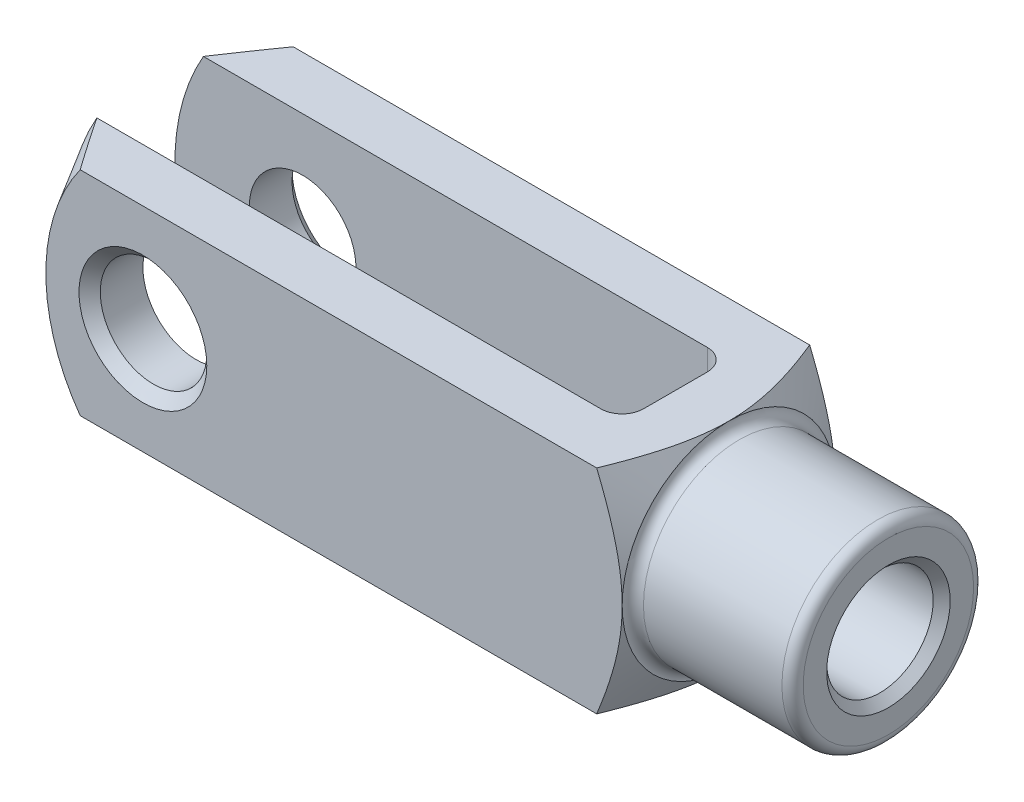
ISO-10303-21;
HEADER;
FILE_DESCRIPTION(('STEP AP214'),'2;1');
FILE_NAME('part.step','',(''),(''),'','','');
FILE_SCHEMA(('AUTOMOTIVE_DESIGN { 1 0 10303 214 1 1 1 1 }'));
ENDSEC;
DATA;
#1=APPLICATION_CONTEXT('core data for automotive mechanical design processes');
#2=APPLICATION_PROTOCOL_DEFINITION('international standard','automotive_design',2000,#1);
#3=PRODUCT_CONTEXT('',#1,'mechanical');
#4=PRODUCT('Part','Part','',(#3));
#5=PRODUCT_RELATED_PRODUCT_CATEGORY('part','',(#4));
#6=PRODUCT_DEFINITION_FORMATION('','',#4);
#7=PRODUCT_DEFINITION_CONTEXT('part definition',#1,'design');
#8=PRODUCT_DEFINITION('design','',#6,#7);
#9=PRODUCT_DEFINITION_SHAPE('','',#8);
#10=(LENGTH_UNIT() NAMED_UNIT(*) SI_UNIT(.MILLI.,.METRE.));
#11=(NAMED_UNIT(*) PLANE_ANGLE_UNIT() SI_UNIT($,.RADIAN.));
#12=(NAMED_UNIT(*) SI_UNIT($,.STERADIAN.) SOLID_ANGLE_UNIT());
#13=UNCERTAINTY_MEASURE_WITH_UNIT(LENGTH_MEASURE(1.E-05),#10,'distance_accuracy_value','');
#14=(GEOMETRIC_REPRESENTATION_CONTEXT(3) GLOBAL_UNCERTAINTY_ASSIGNED_CONTEXT((#13)) GLOBAL_UNIT_ASSIGNED_CONTEXT((#10,
#11,#12)) REPRESENTATION_CONTEXT('',''));
#15=CARTESIAN_POINT('',(0.,0.,0.));
#16=DIRECTION('',(0.,0.,1.));
#17=DIRECTION('',(1.,0.,0.));
#18=AXIS2_PLACEMENT_3D('',#15,#16,#17);
#19=CARTESIAN_POINT('',(-11.,-5.,-1.49999999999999));
#20=DIRECTION('',(0.,-1.,0.));
#21=DIRECTION('',(0.,0.,-1.));
#22=AXIS2_PLACEMENT_3D('',#19,#20,#21);
#23=CYLINDRICAL_SURFACE('',#22,1.);
#24=DIRECTION('',(0.,1.,0.));
#25=VECTOR('',#24,1.);
#26=CARTESIAN_POINT('',(-10.,-5.,-1.49999999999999));
#27=LINE('',#26,#25);
#28=CARTESIAN_POINT('',(-10.,-2.00000000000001,-1.49999999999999));
#29=VERTEX_POINT('',#28);
#30=CARTESIAN_POINT('',(-10.,-5.,-1.49999999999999));
#31=VERTEX_POINT('',#30);
#32=EDGE_CURVE('E362',#29,#31,#27,.F.);
#33=ORIENTED_EDGE('',*,*,#32,.F.);
#34=CARTESIAN_POINT('',(-10.,-2.00000000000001,-1.49999999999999));
#35=CARTESIAN_POINT('',(-10.0000040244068,-1.97434871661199,-1.53421120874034));
#36=CARTESIAN_POINT('',(-10.0017545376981,-1.94783623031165,-1.56772297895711));
#37=CARTESIAN_POINT('',(-10.0083551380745,-1.89333893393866,-1.63311650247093));
#38=CARTESIAN_POINT('',(-10.0131998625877,-1.86535674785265,-1.66500097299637));
#39=CARTESIAN_POINT('',(-10.0316746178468,-1.78000865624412,-1.75742787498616));
#40=CARTESIAN_POINT('',(-10.0492612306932,-1.72072597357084,-1.81542638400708));
#41=CARTESIAN_POINT('',(-10.1015919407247,-1.57251315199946,-1.9469916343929));
#42=CARTESIAN_POINT('',(-10.1404500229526,-1.48167805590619,-2.01671959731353));
#43=CARTESIAN_POINT('',(-10.2290989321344,-1.29476697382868,-2.1415677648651));
#44=CARTESIAN_POINT('',(-10.2789555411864,-1.19866218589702,-2.19659547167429));
#45=CARTESIAN_POINT('',(-10.3701258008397,-1.03200593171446,-2.27834958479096));
#46=CARTESIAN_POINT('',(-10.4096778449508,-0.962194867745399,-2.30864712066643));
#47=CARTESIAN_POINT('',(-10.4913965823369,-0.821458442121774,-2.36238926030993));
#48=CARTESIAN_POINT('',(-10.5335644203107,-0.750532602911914,-2.38583083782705));
#49=CARTESIAN_POINT('',(-10.6625948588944,-0.536940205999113,-2.44613120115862));
#50=CARTESIAN_POINT('',(-10.7522192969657,-0.393043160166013,-2.47316437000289));
#51=CARTESIAN_POINT('',(-10.8932818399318,-0.168755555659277,-2.49559347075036));
#52=CARTESIAN_POINT('',(-10.9439640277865,-0.0886013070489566,-2.4997149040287));
#53=CARTESIAN_POINT('',(-10.9964365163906,-0.00563435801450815,-2.49999523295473));
#54=CARTESIAN_POINT('',(-10.9982182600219,-0.00281717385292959,-2.49999999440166));
#55=CARTESIAN_POINT('',(-11.,0.,-2.5));
#56=B_SPLINE_CURVE_WITH_KNOTS('',3,(#34,#35,#36,#37,#38,#39,#40,#41,#42,#43,#44,#45,#46,#47,#48,
#49,#50,#51,#52,#53,#54,#55),.UNSPECIFIED.,.F.,.F.,(4,2,2,2,2,2,2,2,2,2,4),(0.,
0.128161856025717,0.256102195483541,0.509450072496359,0.870315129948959,1.23340004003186,
1.49037285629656,1.74745893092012,2.26009785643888,2.54460067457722,2.55460068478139),.UNSPECIFIED.);
#57=CARTESIAN_POINT('',(-11.,0.,-2.5));
#58=VERTEX_POINT('',#57);
#59=EDGE_CURVE('E393',#29,#58,#56,.T.);
#60=ORIENTED_EDGE('',*,*,#59,.T.);
#61=DIRECTION('',(0.,1.,0.));
#62=VECTOR('',#61,1.);
#63=CARTESIAN_POINT('',(-11.,5.,-2.49999999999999));
#64=LINE('',#63,#62);
#65=CARTESIAN_POINT('',(-11.,-5.,-2.49999999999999));
#66=VERTEX_POINT('',#65);
#67=EDGE_CURVE('E183',#66,#58,#64,.T.);
#68=ORIENTED_EDGE('',*,*,#67,.F.);
#69=CARTESIAN_POINT('',(-11.,-5.,-1.49999999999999));
#70=DIRECTION('',(0.,-1.,0.));
#71=DIRECTION('',(0.,0.,-1.));
#72=AXIS2_PLACEMENT_3D('',#69,#70,#71);
#73=CIRCLE('',#72,1.);
#74=EDGE_CURVE('E198',#31,#66,#73,.F.);
#75=ORIENTED_EDGE('',*,*,#74,.F.);
#76=EDGE_LOOP('',(#33,#60,#68,#75));
#77=FACE_BOUND('',#76,.T.);
#78=ADVANCED_FACE('F37',(#77),#23,.F.);
#79=CARTESIAN_POINT('',(-10.,-5.,-2.49999999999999));
#80=DIRECTION('',(1.,0.,0.));
#81=DIRECTION('',(0.,0.,-1.));
#82=AXIS2_PLACEMENT_3D('',#79,#80,#81);
#83=PLANE('',#82);
#84=CARTESIAN_POINT('',(-10.,5.,-1.49999999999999));
#85=VERTEX_POINT('',#84);
#86=CARTESIAN_POINT('',(-10.,2.00000000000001,-1.49999999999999));
#87=VERTEX_POINT('',#86);
#88=EDGE_CURVE('E377',#85,#87,#27,.F.);
#89=ORIENTED_EDGE('',*,*,#88,.T.);
#90=CARTESIAN_POINT('',(-10.,0.,0.));
#91=DIRECTION('',(1.,0.,0.));
#92=DIRECTION('',(0.,0.,-1.));
#93=AXIS2_PLACEMENT_3D('',#90,#91,#92);
#94=CIRCLE('',#93,2.5);
#95=CARTESIAN_POINT('',(-10.,2.00000000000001,1.49999999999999));
#96=VERTEX_POINT('',#95);
#97=EDGE_CURVE('E439',#87,#96,#94,.T.);
#98=ORIENTED_EDGE('',*,*,#97,.T.);
#99=DIRECTION('',(0.,1.,0.));
#100=VECTOR('',#99,1.);
#101=CARTESIAN_POINT('',(-10.,5.,1.49999999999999));
#102=LINE('',#101,#100);
#103=CARTESIAN_POINT('',(-10.,5.,1.49999999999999));
#104=VERTEX_POINT('',#103);
#105=EDGE_CURVE('E160',#96,#104,#102,.T.);
#106=ORIENTED_EDGE('',*,*,#105,.T.);
#107=DIRECTION('',(0.,0.,-1.));
#108=VECTOR('',#107,1.);
#109=CARTESIAN_POINT('',(-10.,5.,-2.49999999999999));
#110=LINE('',#109,#108);
#111=EDGE_CURVE('E342',#104,#85,#110,.T.);
#112=ORIENTED_EDGE('',*,*,#111,.T.);
#113=EDGE_LOOP('',(#89,#98,#106,#112));
#114=FACE_BOUND('',#113,.T.);
#115=ADVANCED_FACE('F482',(#114),#83,.F.);
#116=CARTESIAN_POINT('',(-11.,-5.,1.49999999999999));
#117=DIRECTION('',(0.,-1.,0.));
#118=DIRECTION('',(0.,0.,-1.));
#119=AXIS2_PLACEMENT_3D('',#116,#117,#118);
#120=CYLINDRICAL_SURFACE('',#119,1.);
#121=ORIENTED_EDGE('',*,*,#105,.F.);
#122=CARTESIAN_POINT('',(-10.,2.00000000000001,1.49999999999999));
#123=CARTESIAN_POINT('',(-10.0000040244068,1.974348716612,1.53421120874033));
#124=CARTESIAN_POINT('',(-10.0017545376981,1.94783623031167,1.5677229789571));
#125=CARTESIAN_POINT('',(-10.0083551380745,1.89333893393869,1.6331165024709));
#126=CARTESIAN_POINT('',(-10.0131998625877,1.86535674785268,1.66500097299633));
#127=CARTESIAN_POINT('',(-10.0316746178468,1.78000865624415,1.75742787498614));
#128=CARTESIAN_POINT('',(-10.0492612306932,1.72072597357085,1.81542638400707));
#129=CARTESIAN_POINT('',(-10.1015919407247,1.57251315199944,1.94699163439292));
#130=CARTESIAN_POINT('',(-10.1404500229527,1.48167805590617,2.01671959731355));
#131=CARTESIAN_POINT('',(-10.2290989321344,1.29476697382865,2.14156776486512));
#132=CARTESIAN_POINT('',(-10.2789555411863,1.19866218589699,2.1965954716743));
#133=CARTESIAN_POINT('',(-10.3701258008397,1.03200593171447,2.27834958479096));
#134=CARTESIAN_POINT('',(-10.4096778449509,0.962194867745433,2.30864712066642));
#135=CARTESIAN_POINT('',(-10.4913965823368,0.821458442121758,2.36238926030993));
#136=CARTESIAN_POINT('',(-10.5335644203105,0.750532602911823,2.38583083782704));
#137=CARTESIAN_POINT('',(-10.6625948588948,0.536940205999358,2.44613120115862));
#138=CARTESIAN_POINT('',(-10.7522192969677,0.393043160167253,2.4731643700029));
#139=CARTESIAN_POINT('',(-10.8932818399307,0.168755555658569,2.49559347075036));
#140=CARTESIAN_POINT('',(-10.9439640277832,0.0886013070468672,2.4997149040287));
#141=CARTESIAN_POINT('',(-10.9964365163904,0.00563435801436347,2.49999523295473));
#142=CARTESIAN_POINT('',(-10.9982182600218,0.00281717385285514,2.49999999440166));
#143=CARTESIAN_POINT('',(-11.,0.,2.5));
#144=B_SPLINE_CURVE_WITH_KNOTS('',3,(#122,#123,#124,#125,#126,#127,#128,#129,#130,#131,#132,
#133,#134,#135,#136,#137,#138,#139,#140,#141,#142,#143),.UNSPECIFIED.,.F.,.F.,(4,2,2,2,2,2,2,2,
2,2,4),(0.,0.128161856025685,0.256102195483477,0.509450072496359,0.87031512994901,
1.23340004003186,1.49037285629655,1.74745893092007,2.2600978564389,2.54460067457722,
2.55460068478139),.UNSPECIFIED.);
#145=CARTESIAN_POINT('',(-11.,0.,2.5));
#146=VERTEX_POINT('',#145);
#147=EDGE_CURVE('E145',#96,#146,#144,.T.);
#148=ORIENTED_EDGE('',*,*,#147,.T.);
#149=DIRECTION('',(0.,1.,0.));
#150=VECTOR('',#149,1.);
#151=CARTESIAN_POINT('',(-11.,-5.,2.49999999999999));
#152=LINE('',#151,#150);
#153=CARTESIAN_POINT('',(-11.,5.,2.49999999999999));
#154=VERTEX_POINT('',#153);
#155=EDGE_CURVE('E159',#154,#146,#152,.F.);
#156=ORIENTED_EDGE('',*,*,#155,.F.);
#157=CARTESIAN_POINT('',(-11.,5.,1.49999999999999));
#158=DIRECTION('',(0.,1.,0.));
#159=DIRECTION('',(0.,0.,1.));
#160=AXIS2_PLACEMENT_3D('',#157,#158,#159);
#161=CIRCLE('',#160,1.);
#162=EDGE_CURVE('E190',#104,#154,#161,.F.);
#163=ORIENTED_EDGE('',*,*,#162,.F.);
#164=EDGE_LOOP('',(#121,#148,#156,#163));
#165=FACE_BOUND('',#164,.T.);
#166=ADVANCED_FACE('F156',(#165),#120,.F.);
#167=CARTESIAN_POINT('',(-36.,-5.,-2.5));
#168=DIRECTION('',(0.,0.,-1.));
#169=DIRECTION('',(-1.,0.,0.));
#170=AXIS2_PLACEMENT_3D('',#167,#168,#169);
#171=PLANE('',#170);
#172=CARTESIAN_POINT('',(-30.,0.,-2.5));
#173=DIRECTION('',(0.,0.,-1.));
#174=DIRECTION('',(-1.,0.,0.));
#175=AXIS2_PLACEMENT_3D('',#172,#173,#174);
#176=CIRCLE('',#175,2.5);
#177=CARTESIAN_POINT('',(-32.5,0.,-2.5));
#178=VERTEX_POINT('',#177);
#179=EDGE_CURVE('E372',#178,#178,#176,.F.);
#180=ORIENTED_EDGE('',*,*,#179,.F.);
#181=EDGE_LOOP('',(#180));
#182=FACE_BOUND('',#181,.T.);
#183=CARTESIAN_POINT('',(-26.,0.,-2.5));
#184=DIRECTION('',(0.,0.,1.));
#185=DIRECTION('',(1.,0.,0.));
#186=AXIS2_PLACEMENT_3D('',#183,#184,#185);
#187=CIRCLE('',#186,10.);
#188=CARTESIAN_POINT('',(-34.6602540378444,5.,-2.5));
#189=VERTEX_POINT('',#188);
#190=CARTESIAN_POINT('',(-34.6602540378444,-5.,-2.5));
#191=VERTEX_POINT('',#190);
#192=EDGE_CURVE('E281',#189,#191,#187,.T.);
#193=ORIENTED_EDGE('',*,*,#192,.T.);
#194=DIRECTION('',(-1.,0.,0.));
#195=VECTOR('',#194,1.);
#196=CARTESIAN_POINT('',(-36.,-5.,-2.5));
#197=LINE('',#196,#195);
#198=EDGE_CURVE('E337',#66,#191,#197,.T.);
#199=ORIENTED_EDGE('',*,*,#198,.F.);
#200=ORIENTED_EDGE('',*,*,#67,.T.);
#201=CARTESIAN_POINT('',(-11.,5.,-2.49999999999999));
#202=VERTEX_POINT('',#201);
#203=EDGE_CURVE('E179',#58,#202,#64,.T.);
#204=ORIENTED_EDGE('',*,*,#203,.T.);
#205=DIRECTION('',(-1.,0.,0.));
#206=VECTOR('',#205,1.);
#207=CARTESIAN_POINT('',(-36.,5.,-2.5));
#208=LINE('',#207,#206);
#209=EDGE_CURVE('E350',#202,#189,#208,.T.);
#210=ORIENTED_EDGE('',*,*,#209,.T.);
#211=EDGE_LOOP('',(#193,#199,#200,#204,#210));
#212=FACE_BOUND('',#211,.T.);
#213=ADVANCED_FACE('F396',(#182,#212),#171,.F.);
#214=CARTESIAN_POINT('',(-36.,-5.,2.50000000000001));
#215=DIRECTION('',(0.,0.,1.));
#216=DIRECTION('',(1.,0.,0.));
#217=AXIS2_PLACEMENT_3D('',#214,#215,#216);
#218=PLANE('',#217);
#219=CARTESIAN_POINT('',(-30.,0.,2.5));
#220=DIRECTION('',(0.,0.,1.));
#221=DIRECTION('',(1.,0.,0.));
#222=AXIS2_PLACEMENT_3D('',#219,#220,#221);
#223=CIRCLE('',#222,2.5);
#224=CARTESIAN_POINT('',(-27.5,0.,2.5));
#225=VERTEX_POINT('',#224);
#226=EDGE_CURVE('E349',#225,#225,#223,.F.);
#227=ORIENTED_EDGE('',*,*,#226,.F.);
#228=EDGE_LOOP('',(#227));
#229=FACE_BOUND('',#228,.T.);
#230=DIRECTION('',(1.,0.,0.));
#231=VECTOR('',#230,1.);
#232=CARTESIAN_POINT('',(-36.,-5.,2.50000000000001));
#233=LINE('',#232,#231);
#234=CARTESIAN_POINT('',(-34.6602540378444,-5.,2.50000000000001));
#235=VERTEX_POINT('',#234);
#236=CARTESIAN_POINT('',(-11.,-5.,2.49999999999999));
#237=VERTEX_POINT('',#236);
#238=EDGE_CURVE('E341',#235,#237,#233,.T.);
#239=ORIENTED_EDGE('',*,*,#238,.F.);
#240=CARTESIAN_POINT('',(-26.,0.,2.50000000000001));
#241=DIRECTION('',(0.,0.,1.));
#242=DIRECTION('',(1.,0.,0.));
#243=AXIS2_PLACEMENT_3D('',#240,#241,#242);
#244=CIRCLE('',#243,10.);
#245=CARTESIAN_POINT('',(-34.6602540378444,5.,2.50000000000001));
#246=VERTEX_POINT('',#245);
#247=EDGE_CURVE('E417',#246,#235,#244,.T.);
#248=ORIENTED_EDGE('',*,*,#247,.F.);
#249=DIRECTION('',(1.,0.,0.));
#250=VECTOR('',#249,1.);
#251=CARTESIAN_POINT('',(-36.,5.,2.50000000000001));
#252=LINE('',#251,#250);
#253=EDGE_CURVE('E176',#246,#154,#252,.T.);
#254=ORIENTED_EDGE('',*,*,#253,.T.);
#255=ORIENTED_EDGE('',*,*,#155,.T.);
#256=EDGE_CURVE('E164',#146,#237,#152,.F.);
#257=ORIENTED_EDGE('',*,*,#256,.T.);
#258=EDGE_LOOP('',(#239,#248,#254,#255,#257));
#259=FACE_BOUND('',#258,.T.);
#260=ADVANCED_FACE('F173',(#229,#259),#218,.F.);
#261=CARTESIAN_POINT('',(-36.,-5.,5.));
#262=DIRECTION('',(0.,0.,1.));
#263=DIRECTION('',(1.,0.,0.));
#264=AXIS2_PLACEMENT_3D('',#261,#262,#263);
#265=PLANE('',#264);
#266=CARTESIAN_POINT('',(-30.,0.,5.));
#267=DIRECTION('',(0.,0.,1.));
#268=DIRECTION('',(1.,0.,0.));
#269=AXIS2_PLACEMENT_3D('',#266,#267,#268);
#270=CIRCLE('',#269,3.);
#271=CARTESIAN_POINT('',(-27.,0.,5.));
#272=VERTEX_POINT('',#271);
#273=EDGE_CURVE('E239',#272,#272,#270,.F.);
#274=ORIENTED_EDGE('',*,*,#273,.T.);
#275=EDGE_LOOP('',(#274));
#276=FACE_BOUND('',#275,.T.);
#277=DIRECTION('',(1.,0.,0.));
#278=VECTOR('',#277,1.);
#279=CARTESIAN_POINT('',(-36.,5.,5.));
#280=LINE('',#279,#278);
#281=CARTESIAN_POINT('',(-32.9437612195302,5.,5.));
#282=VERTEX_POINT('',#281);
#283=CARTESIAN_POINT('',(-8.69573155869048,5.,5.));
#284=VERTEX_POINT('',#283);
#285=EDGE_CURVE('E369',#282,#284,#280,.T.);
#286=ORIENTED_EDGE('',*,*,#285,.F.);
#287=CARTESIAN_POINT('',(-26.,0.,5.));
#288=DIRECTION('',(0.,0.,1.));
#289=DIRECTION('',(1.,0.,0.));
#290=AXIS2_PLACEMENT_3D('',#287,#288,#289);
#291=CIRCLE('',#290,8.55662432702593);
#292=CARTESIAN_POINT('',(-32.9437612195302,-5.,5.));
#293=VERTEX_POINT('',#292);
#294=EDGE_CURVE('E61',#282,#293,#291,.T.);
#295=ORIENTED_EDGE('',*,*,#294,.T.);
#296=DIRECTION('',(1.,0.,0.));
#297=VECTOR('',#296,1.);
#298=CARTESIAN_POINT('',(-36.,-5.,5.));
#299=LINE('',#298,#297);
#300=CARTESIAN_POINT('',(-8.69573155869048,-5.,5.));
#301=VERTEX_POINT('',#300);
#302=EDGE_CURVE('E366',#293,#301,#299,.T.);
#303=ORIENTED_EDGE('',*,*,#302,.T.);
#304=CARTESIAN_POINT('',(-11.1779367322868,-10.2120217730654,5.));
#305=CARTESIAN_POINT('',(-11.0501732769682,-9.96559184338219,5.));
#306=CARTESIAN_POINT('',(-10.9230852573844,-9.71880849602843,5.));
#307=CARTESIAN_POINT('',(-10.6706182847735,-9.22435307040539,5.));
#308=CARTESIAN_POINT('',(-10.5452394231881,-8.97668094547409,5.));
#309=CARTESIAN_POINT('',(-10.2963461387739,-8.47986010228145,5.));
#310=CARTESIAN_POINT('',(-10.1728353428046,-8.23070956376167,5.));
#311=CARTESIAN_POINT('',(-9.92841321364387,-7.73114008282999,5.));
#312=CARTESIAN_POINT('',(-9.80750183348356,-7.48072116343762,5.));
#313=CARTESIAN_POINT('',(-9.56160218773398,-6.96287579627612,5.));
#314=CARTESIAN_POINT('',(-9.43682075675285,-6.69535084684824,5.));
#315=CARTESIAN_POINT('',(-9.19200723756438,-6.15811043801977,5.));
#316=CARTESIAN_POINT('',(-9.07197539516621,-5.88839486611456,5.));
#317=CARTESIAN_POINT('',(-8.8382236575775,-5.34637384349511,5.));
#318=CARTESIAN_POINT('',(-8.72450095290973,-5.07406960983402,5.));
#319=CARTESIAN_POINT('',(-8.50540502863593,-4.5261205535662,5.));
#320=CARTESIAN_POINT('',(-8.40003081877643,-4.25047613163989,5.));
#321=CARTESIAN_POINT('',(-8.23962651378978,-3.80384985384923,5.));
#322=CARTESIAN_POINT('',(-8.18103937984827,-3.63414725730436,5.));
#323=CARTESIAN_POINT('',(-8.06890917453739,-3.2930890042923,5.));
#324=CARTESIAN_POINT('',(-8.01536567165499,-3.12173349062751,5.));
#325=CARTESIAN_POINT('',(-7.91431435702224,-2.77724742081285,5.));
#326=CARTESIAN_POINT('',(-7.86680629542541,-2.60411693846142,5.));
#327=CARTESIAN_POINT('',(-7.77895823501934,-2.2560245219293,5.));
#328=CARTESIAN_POINT('',(-7.73861845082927,-2.08106253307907,5.));
#329=CARTESIAN_POINT('',(-7.66717141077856,-1.73351278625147,5.));
#330=CARTESIAN_POINT('',(-7.63587016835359,-1.56096530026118,5.));
#331=CARTESIAN_POINT('',(-7.58237487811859,-1.21448473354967,5.));
#332=CARTESIAN_POINT('',(-7.56017887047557,-1.04055195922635,5.));
#333=CARTESIAN_POINT('',(-7.52581186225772,-0.691784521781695,5.));
#334=CARTESIAN_POINT('',(-7.5136352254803,-0.516950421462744,5.));
#335=CARTESIAN_POINT('',(-7.49984755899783,-0.166864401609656,5.));
#336=CARTESIAN_POINT('',(-7.49823615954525,0.00838750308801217,5.));
#337=CARTESIAN_POINT('',(-7.50538143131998,0.345895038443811,5.));
#338=CARTESIAN_POINT('',(-7.51339117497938,0.508167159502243,5.));
#339=CARTESIAN_POINT('',(-7.5382276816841,0.832028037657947,5.));
#340=CARTESIAN_POINT('',(-7.55505442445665,0.993616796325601,5.));
#341=CARTESIAN_POINT('',(-7.59690806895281,1.31580153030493,5.));
#342=CARTESIAN_POINT('',(-7.62193920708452,1.47639694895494,5.));
#343=CARTESIAN_POINT('',(-7.67937635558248,1.79625495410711,5.));
#344=CARTESIAN_POINT('',(-7.71178257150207,1.95551750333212,5.));
#345=CARTESIAN_POINT('',(-7.78410006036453,2.27716431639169,5.));
#346=CARTESIAN_POINT('',(-7.82420141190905,2.43950551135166,5.));
#347=CARTESIAN_POINT('',(-7.91029090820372,2.76260917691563,5.));
#348=CARTESIAN_POINT('',(-7.95627910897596,2.9233716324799,5.));
#349=CARTESIAN_POINT('',(-8.0532521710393,3.24336572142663,5.));
#350=CARTESIAN_POINT('',(-8.10423680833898,3.40259742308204,5.));
#351=CARTESIAN_POINT('',(-8.21042325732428,3.71963213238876,5.));
#352=CARTESIAN_POINT('',(-8.26562484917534,3.87743521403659,5.));
#353=CARTESIAN_POINT('',(-8.38422548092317,4.20455781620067,5.));
#354=CARTESIAN_POINT('',(-8.44792594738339,4.37376771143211,5.));
#355=CARTESIAN_POINT('',(-8.57878961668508,4.71084645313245,5.));
#356=CARTESIAN_POINT('',(-8.64595298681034,4.87871523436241,5.));
#357=CARTESIAN_POINT('',(-8.85177672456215,5.38062019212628,5.));
#358=CARTESIAN_POINT('',(-8.99474620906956,5.712888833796,5.));
#359=CARTESIAN_POINT('',(-9.28888284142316,6.37408373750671,5.));
#360=CARTESIAN_POINT('',(-9.44005700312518,6.70300684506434,5.));
#361=CARTESIAN_POINT('',(-9.7482557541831,7.35804934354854,5.));
#362=CARTESIAN_POINT('',(-9.90527972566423,7.68416902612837,5.));
#363=CARTESIAN_POINT('',(-10.2241567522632,8.33526441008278,5.));
#364=CARTESIAN_POINT('',(-10.3860230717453,8.66023359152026,5.));
#365=CARTESIAN_POINT('',(-10.7130699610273,9.30850558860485,5.));
#366=CARTESIAN_POINT('',(-10.8782506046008,9.63180836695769,5.));
#367=CARTESIAN_POINT('',(-11.2110861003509,10.2769312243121,5.));
#368=CARTESIAN_POINT('',(-11.3787396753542,10.5987519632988,5.));
#369=CARTESIAN_POINT('',(-11.716060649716,11.2413369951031,5.));
#370=CARTESIAN_POINT('',(-11.8857280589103,11.5621012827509,5.));
#371=CARTESIAN_POINT('',(-12.3464966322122,12.4279667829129,5.));
#372=CARTESIAN_POINT('',(-12.6391179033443,12.9722587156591,5.));
#373=CARTESIAN_POINT('',(-13.2276625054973,14.0591501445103,5.));
#374=CARTESIAN_POINT('',(-13.5235862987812,14.6017493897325,5.));
#375=CARTESIAN_POINT('',(-14.1161130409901,15.6825374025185,5.));
#376=CARTESIAN_POINT('',(-14.4127023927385,16.220733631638,5.));
#377=CARTESIAN_POINT('',(-15.0076407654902,17.296041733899,5.));
#378=CARTESIAN_POINT('',(-15.3059895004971,17.8331537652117,5.));
#379=CARTESIAN_POINT('',(-15.6049680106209,18.3699124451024,5.));
#380=B_SPLINE_CURVE_WITH_KNOTS('',3,(#304,#305,#306,#307,#308,#309,#310,#311,#312,#313,#314,
#315,#316,#317,#318,#319,#320,#321,#322,#323,#324,#325,#326,#327,#328,#329,#330,#331,#332,#333,
#334,#335,#336,#337,#338,#339,#340,#341,#342,#343,#344,#345,#346,#347,#348,#349,#350,#351,#352,
#353,#354,#355,#356,#357,#358,#359,#360,#361,#362,#363,#364,#365,#366,#367,#368,#369,#370,#371,
#372,#373,#374,#375,#376,#377,#378,#379),.UNSPECIFIED.,.F.,.F.,(4,2,2,2,2,2,2,2,2,2,2,2,2,2,2,2,
2,2,2,2,2,2,2,2,2,2,2,2,2,2,2,2,2,2,2,2,2,4),(0.,0.832746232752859,1.66553684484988,
2.49977764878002,3.33400336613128,4.21955297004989,5.10514834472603,5.99034614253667,
6.87543878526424,7.41396978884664,7.9524546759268,8.49091726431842,9.02939597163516,
9.55527179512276,10.0810343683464,10.606500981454,11.1319492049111,11.6191099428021,
12.1062695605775,12.5936811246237,13.081106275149,13.5826395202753,14.0841775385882,
14.5856930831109,15.0871825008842,15.6295449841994,16.1719336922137,17.2569226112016,
18.3428541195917,19.4286712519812,20.5177991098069,21.6069512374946,22.6955592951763,
23.7841726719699,25.6380502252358,27.4921906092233,29.3357115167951,31.1789405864),.UNSPECIFIED.);
#381=CARTESIAN_POINT('',(-7.5,0.,5.));
#382=VERTEX_POINT('',#381);
#383=EDGE_CURVE('E309',#382,#301,#380,.F.);
#384=ORIENTED_EDGE('',*,*,#383,.F.);
#385=EDGE_CURVE('E307',#284,#382,#380,.F.);
#386=ORIENTED_EDGE('',*,*,#385,.F.);
#387=EDGE_LOOP('',(#286,#295,#303,#384,#386));
#388=FACE_BOUND('',#387,.T.);
#389=ADVANCED_FACE('F292',(#276,#388),#265,.T.);
#390=CARTESIAN_POINT('',(-36.,-5.,5.));
#391=DIRECTION('',(0.,-1.,0.));
#392=DIRECTION('',(0.,0.,-1.));
#393=AXIS2_PLACEMENT_3D('',#390,#391,#392);
#394=PLANE('',#393);
#395=ORIENTED_EDGE('',*,*,#198,.T.);
#396=CARTESIAN_POINT('',(-38.6161570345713,-5.,3.68485843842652));
#397=CARTESIAN_POINT('',(-38.3728735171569,-5.,3.29314977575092));
#398=CARTESIAN_POINT('',(-38.1289237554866,-5.,2.90185301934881));
#399=CARTESIAN_POINT('',(-37.6393799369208,-5.,2.12027873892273));
#400=CARTESIAN_POINT('',(-37.3937858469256,-5.,1.73000123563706));
#401=CARTESIAN_POINT('',(-36.9003569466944,-5.,0.950211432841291));
#402=CARTESIAN_POINT('',(-36.652519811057,-5.,0.560700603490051));
#403=CARTESIAN_POINT('',(-36.1544780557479,-5.,-0.216801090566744));
#404=CARTESIAN_POINT('',(-35.9042734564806,-5.,-0.604791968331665));
#405=CARTESIAN_POINT('',(-35.3904709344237,-5.,-1.39500462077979));
#406=CARTESIAN_POINT('',(-35.1267492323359,-5.,-1.79714601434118));
#407=CARTESIAN_POINT('',(-34.5953246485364,-5.,-2.59878951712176));
#408=CARTESIAN_POINT('',(-34.3276218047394,-5.,-2.99829165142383));
#409=CARTESIAN_POINT('',(-33.7872819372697,-5.,-3.79351799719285));
#410=CARTESIAN_POINT('',(-33.5146487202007,-5.,-4.18924479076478));
#411=CARTESIAN_POINT('',(-32.9626344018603,-5.,-4.97595833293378));
#412=CARTESIAN_POINT('',(-32.6832536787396,-5.,-5.36694534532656));
#413=CARTESIAN_POINT('',(-32.2585707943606,-5.,-5.94654587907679));
#414=CARTESIAN_POINT('',(-32.116755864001,-5.,-6.137714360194));
#415=CARTESIAN_POINT('',(-31.8304276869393,-5.,-6.51801720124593));
#416=CARTESIAN_POINT('',(-31.6859145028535,-5.,-6.70715160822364));
#417=CARTESIAN_POINT('',(-31.3934623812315,-5.,-7.08318222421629));
#418=CARTESIAN_POINT('',(-31.2455189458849,-5.,-7.27007494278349));
#419=CARTESIAN_POINT('',(-30.945732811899,-5.,-7.64069985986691));
#420=CARTESIAN_POINT('',(-30.7938903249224,-5.,-7.8244322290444));
#421=CARTESIAN_POINT('',(-30.4870234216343,-5.,-8.18596657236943));
#422=CARTESIAN_POINT('',(-30.3320483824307,-5.,-8.36381030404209));
#423=CARTESIAN_POINT('',(-30.0162560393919,-5.,-8.71434786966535));
#424=CARTESIAN_POINT('',(-29.8554372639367,-5.,-8.88704038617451));
#425=CARTESIAN_POINT('',(-29.5268930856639,-5.,-9.22500913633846));
#426=CARTESIAN_POINT('',(-29.3591840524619,-5.,-9.39030119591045));
#427=CARTESIAN_POINT('',(-29.014665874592,-5.,-9.71104872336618));
#428=CARTESIAN_POINT('',(-28.8378629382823,-5.,-9.86651074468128));
#429=CARTESIAN_POINT('',(-28.5607263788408,-5.,-10.0916231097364));
#430=CARTESIAN_POINT('',(-28.4646388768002,-5.,-10.1664975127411));
#431=CARTESIAN_POINT('',(-28.2689237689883,-5.,-10.3115375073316));
#432=CARTESIAN_POINT('',(-28.1692954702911,-5.,-10.3817021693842));
#433=CARTESIAN_POINT('',(-27.9662036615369,-5.,-10.5161269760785));
#434=CARTESIAN_POINT('',(-27.8627432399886,-5.,-10.5803917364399));
#435=CARTESIAN_POINT('',(-27.6516728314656,-5.,-10.7016113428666));
#436=CARTESIAN_POINT('',(-27.5440639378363,-5.,-10.7585680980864));
#437=CARTESIAN_POINT('',(-27.2646742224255,-5.,-10.8919682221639));
#438=CARTESIAN_POINT('',(-27.0897644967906,-5.,-10.9622087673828));
#439=CARTESIAN_POINT('',(-26.8207698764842,-5.,-11.0456804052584));
#440=CARTESIAN_POINT('',(-26.7300249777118,-5.,-11.0698525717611));
#441=CARTESIAN_POINT('',(-26.5467659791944,-5.,-11.1100471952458));
#442=CARTESIAN_POINT('',(-26.4542528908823,-5.,-11.1260741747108));
#443=CARTESIAN_POINT('',(-26.267160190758,-5.,-11.1494213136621));
#444=CARTESIAN_POINT('',(-26.1725691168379,-5.,-11.1566505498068));
#445=CARTESIAN_POINT('',(-25.9831348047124,-5.,-11.1617580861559));
#446=CARTESIAN_POINT('',(-25.8882915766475,-5.,-11.1596367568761));
#447=CARTESIAN_POINT('',(-25.6992539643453,-5.,-11.1461448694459));
#448=CARTESIAN_POINT('',(-25.6050597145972,-5.,-11.1347724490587));
#449=CARTESIAN_POINT('',(-25.4181469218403,-5.,-11.1033021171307));
#450=CARTESIAN_POINT('',(-25.3254286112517,-5.,-11.0832028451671));
#451=CARTESIAN_POINT('',(-25.1250906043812,-5.,-11.0306393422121));
#452=CARTESIAN_POINT('',(-25.0178926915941,-5.,-10.9965741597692));
#453=CARTESIAN_POINT('',(-24.8069839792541,-5.,-10.9189382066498));
#454=CARTESIAN_POINT('',(-24.7032751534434,-5.,-10.8753621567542));
#455=CARTESIAN_POINT('',(-24.4992757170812,-5.,-10.7801830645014));
#456=CARTESIAN_POINT('',(-24.3989959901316,-5.,-10.728556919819));
#457=CARTESIAN_POINT('',(-24.2021050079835,-5.,-10.6188116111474));
#458=CARTESIAN_POINT('',(-24.1054933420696,-5.,-10.5606931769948));
#459=CARTESIAN_POINT('',(-23.8845388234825,-5.,-10.4192139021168));
#460=CARTESIAN_POINT('',(-23.7614975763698,-5.,-10.3338274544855));
#461=CARTESIAN_POINT('',(-23.5206980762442,-5.,-10.1558693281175));
#462=CARTESIAN_POINT('',(-23.4029423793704,-5.,-10.063294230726));
#463=CARTESIAN_POINT('',(-23.1718232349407,-5.,-9.87240526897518));
#464=CARTESIAN_POINT('',(-23.0584686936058,-5.,-9.77408068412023));
#465=CARTESIAN_POINT('',(-22.8357596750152,-5.,-9.57306098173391));
#466=CARTESIAN_POINT('',(-22.7264045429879,-5.,-9.47036658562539));
#467=CARTESIAN_POINT('',(-22.5103906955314,-5.,-9.26077594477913));
#468=CARTESIAN_POINT('',(-22.4037548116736,-5.,-9.15385625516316));
#469=CARTESIAN_POINT('',(-22.1934548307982,-5.,-8.93712706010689));
#470=CARTESIAN_POINT('',(-22.0897909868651,-5.,-8.82731731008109));
#471=CARTESIAN_POINT('',(-21.7828585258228,-5.,-8.49460182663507));
#472=CARTESIAN_POINT('',(-21.5834078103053,-5.,-8.26817141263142));
#473=CARTESIAN_POINT('',(-21.2495908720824,-5.,-7.8761176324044));
#474=CARTESIAN_POINT('',(-21.1132838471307,-5.,-7.71212538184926));
#475=CARTESIAN_POINT('',(-20.8438776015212,-5.,-7.3814709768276));
#476=CARTESIAN_POINT('',(-20.7107790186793,-5.,-7.21480830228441));
#477=CARTESIAN_POINT('',(-20.449318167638,-5.,-6.88192327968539));
#478=CARTESIAN_POINT('',(-20.3209145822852,-5.,-6.71573326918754));
#479=CARTESIAN_POINT('',(-20.0664074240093,-5.,-6.3816796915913));
#480=CARTESIAN_POINT('',(-19.9403031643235,-5.,-6.21381664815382));
#481=CARTESIAN_POINT('',(-19.8151415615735,-5.,-6.04526137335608));
#482=B_SPLINE_CURVE_WITH_KNOTS('',3,(#396,#397,#398,#399,#400,#401,#402,#403,#404,#405,#406,
#407,#408,#409,#410,#411,#412,#413,#414,#415,#416,#417,#418,#419,#420,#421,#422,#423,#424,#425,
#426,#427,#428,#429,#430,#431,#432,#433,#434,#435,#436,#437,#438,#439,#440,#441,#442,#443,#444,
#445,#446,#447,#448,#449,#450,#451,#452,#453,#454,#455,#456,#457,#458,#459,#460,#461,#462,#463,
#464,#465,#466,#467,#468,#469,#470,#471,#472,#473,#474,#475,#476,#477,#478,#479,#480,#481),
.UNSPECIFIED.,.F.,.F.,(4,2,2,2,2,2,2,2,2,2,2,2,2,2,2,2,2,2,2,2,2,2,2,2,2,2,2,2,2,2,2,2,2,2,2,2,
2,2,2,2,2,2,4),(0.,1.38333209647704,2.7666921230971,4.15170397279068,5.53670389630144,
6.979392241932,8.42206685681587,9.86367153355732,11.3051956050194,12.0192581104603,
12.733304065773,13.4483461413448,14.1633494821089,14.8709323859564,15.5786947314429,
16.2848631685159,16.9905557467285,17.355888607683,17.721293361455,18.0864097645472,
18.4514305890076,19.0145750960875,19.2959979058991,19.5772642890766,19.8614134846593,
20.1455514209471,20.4297465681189,20.7139860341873,21.0508866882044,21.3879748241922,
21.7260487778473,22.0640847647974,22.5130303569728,22.9621907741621,23.4122171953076,
23.8621696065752,24.3151211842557,24.7681112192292,25.6730749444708,26.3127741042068,
26.9525994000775,27.5826270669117,28.2124633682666),.UNSPECIFIED.);
#483=CARTESIAN_POINT('',(-32.9437612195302,-5.,-5.));
#484=VERTEX_POINT('',#483);
#485=EDGE_CURVE('E280',#191,#484,#482,.T.);
#486=ORIENTED_EDGE('',*,*,#485,.T.);
#487=DIRECTION('',(1.,0.,0.));
#488=VECTOR('',#487,1.);
#489=CARTESIAN_POINT('',(-36.,-5.,-5.));
#490=LINE('',#489,#488);
#491=CARTESIAN_POINT('',(-8.69573155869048,-5.,-5.));
#492=VERTEX_POINT('',#491);
#493=EDGE_CURVE('E363',#484,#492,#490,.T.);
#494=ORIENTED_EDGE('',*,*,#493,.T.);
#495=CARTESIAN_POINT('',(-11.1779367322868,-5.,-10.2120217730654));
#496=CARTESIAN_POINT('',(-11.0501732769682,-5.,-9.96559184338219));
#497=CARTESIAN_POINT('',(-10.9230852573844,-5.,-9.71880849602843));
#498=CARTESIAN_POINT('',(-10.6706182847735,-5.,-9.22435307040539));
#499=CARTESIAN_POINT('',(-10.5452394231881,-5.,-8.97668094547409));
#500=CARTESIAN_POINT('',(-10.2963461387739,-5.,-8.47986010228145));
#501=CARTESIAN_POINT('',(-10.1728353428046,-5.,-8.23070956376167));
#502=CARTESIAN_POINT('',(-9.92841321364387,-5.,-7.73114008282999));
#503=CARTESIAN_POINT('',(-9.80750183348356,-5.,-7.48072116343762));
#504=CARTESIAN_POINT('',(-9.56160218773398,-5.,-6.96287579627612));
#505=CARTESIAN_POINT('',(-9.43682075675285,-5.,-6.69535084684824));
#506=CARTESIAN_POINT('',(-9.19200723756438,-5.,-6.15811043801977));
#507=CARTESIAN_POINT('',(-9.07197539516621,-5.,-5.88839486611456));
#508=CARTESIAN_POINT('',(-8.8382236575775,-5.,-5.34637384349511));
#509=CARTESIAN_POINT('',(-8.72450095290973,-5.,-5.07406960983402));
#510=CARTESIAN_POINT('',(-8.50540502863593,-5.,-4.5261205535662));
#511=CARTESIAN_POINT('',(-8.40003081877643,-5.,-4.25047613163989));
#512=CARTESIAN_POINT('',(-8.23962651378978,-5.,-3.80384985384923));
#513=CARTESIAN_POINT('',(-8.18103937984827,-5.,-3.63414725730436));
#514=CARTESIAN_POINT('',(-8.06890917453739,-5.,-3.2930890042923));
#515=CARTESIAN_POINT('',(-8.01536567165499,-5.,-3.12173349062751));
#516=CARTESIAN_POINT('',(-7.91431435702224,-5.,-2.77724742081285));
#517=CARTESIAN_POINT('',(-7.86680629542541,-5.,-2.60411693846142));
#518=CARTESIAN_POINT('',(-7.77895823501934,-5.,-2.2560245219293));
#519=CARTESIAN_POINT('',(-7.73861845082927,-5.,-2.08106253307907));
#520=CARTESIAN_POINT('',(-7.66717141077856,-5.,-1.73351278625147));
#521=CARTESIAN_POINT('',(-7.63587016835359,-5.,-1.56096530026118));
#522=CARTESIAN_POINT('',(-7.58237487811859,-5.,-1.21448473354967));
#523=CARTESIAN_POINT('',(-7.56017887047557,-5.,-1.04055195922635));
#524=CARTESIAN_POINT('',(-7.52581186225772,-5.,-0.691784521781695));
#525=CARTESIAN_POINT('',(-7.5136352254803,-5.,-0.516950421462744));
#526=CARTESIAN_POINT('',(-7.49984755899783,-5.,-0.166864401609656));
#527=CARTESIAN_POINT('',(-7.49823615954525,-5.,0.00838750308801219));
#528=CARTESIAN_POINT('',(-7.50538143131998,-5.,0.34589503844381));
#529=CARTESIAN_POINT('',(-7.51339117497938,-5.,0.508167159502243));
#530=CARTESIAN_POINT('',(-7.5382276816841,-5.,0.832028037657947));
#531=CARTESIAN_POINT('',(-7.55505442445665,-5.,0.9936167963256));
#532=CARTESIAN_POINT('',(-7.59690806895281,-5.,1.31580153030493));
#533=CARTESIAN_POINT('',(-7.62193920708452,-5.,1.47639694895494));
#534=CARTESIAN_POINT('',(-7.67937635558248,-5.,1.79625495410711));
#535=CARTESIAN_POINT('',(-7.71178257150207,-5.,1.95551750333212));
#536=CARTESIAN_POINT('',(-7.78410006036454,-5.,2.27716431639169));
#537=CARTESIAN_POINT('',(-7.82420141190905,-5.,2.43950551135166));
#538=CARTESIAN_POINT('',(-7.91029090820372,-5.,2.76260917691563));
#539=CARTESIAN_POINT('',(-7.95627910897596,-5.,2.9233716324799));
#540=CARTESIAN_POINT('',(-8.0532521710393,-5.,3.24336572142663));
#541=CARTESIAN_POINT('',(-8.10423680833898,-5.,3.40259742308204));
#542=CARTESIAN_POINT('',(-8.21042325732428,-5.,3.71963213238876));
#543=CARTESIAN_POINT('',(-8.26562484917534,-5.,3.87743521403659));
#544=CARTESIAN_POINT('',(-8.38422548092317,-5.,4.20455781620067));
#545=CARTESIAN_POINT('',(-8.44792594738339,-5.,4.37376771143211));
#546=CARTESIAN_POINT('',(-8.57878961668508,-5.,4.71084645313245));
#547=CARTESIAN_POINT('',(-8.64595298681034,-5.,4.87871523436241));
#548=CARTESIAN_POINT('',(-8.85177672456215,-5.,5.38062019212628));
#549=CARTESIAN_POINT('',(-8.99474620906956,-5.,5.71288883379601));
#550=CARTESIAN_POINT('',(-9.28888284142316,-5.,6.37408373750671));
#551=CARTESIAN_POINT('',(-9.44005700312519,-5.,6.70300684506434));
#552=CARTESIAN_POINT('',(-9.7482557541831,-5.,7.35804934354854));
#553=CARTESIAN_POINT('',(-9.90527972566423,-5.,7.68416902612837));
#554=CARTESIAN_POINT('',(-10.2241567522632,-5.,8.33526441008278));
#555=CARTESIAN_POINT('',(-10.3860230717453,-5.,8.66023359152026));
#556=CARTESIAN_POINT('',(-10.7130699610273,-5.,9.30850558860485));
#557=CARTESIAN_POINT('',(-10.8782506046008,-5.,9.63180836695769));
#558=CARTESIAN_POINT('',(-11.2110861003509,-5.,10.2769312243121));
#559=CARTESIAN_POINT('',(-11.3787396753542,-5.,10.5987519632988));
#560=CARTESIAN_POINT('',(-11.716060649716,-5.,11.241336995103));
#561=CARTESIAN_POINT('',(-11.8857280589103,-5.,11.5621012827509));
#562=CARTESIAN_POINT('',(-12.3464966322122,-5.,12.4279667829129));
#563=CARTESIAN_POINT('',(-12.6391179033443,-5.,12.9722587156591));
#564=CARTESIAN_POINT('',(-13.2276625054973,-5.,14.0591501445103));
#565=CARTESIAN_POINT('',(-13.5235862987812,-5.,14.6017493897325));
#566=CARTESIAN_POINT('',(-14.1161130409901,-5.,15.6825374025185));
#567=CARTESIAN_POINT('',(-14.4127023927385,-5.,16.220733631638));
#568=CARTESIAN_POINT('',(-15.0076407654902,-5.,17.296041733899));
#569=CARTESIAN_POINT('',(-15.3059895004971,-5.,17.8331537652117));
#570=CARTESIAN_POINT('',(-15.6049680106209,-5.,18.3699124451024));
#571=B_SPLINE_CURVE_WITH_KNOTS('',3,(#495,#496,#497,#498,#499,#500,#501,#502,#503,#504,#505,
#506,#507,#508,#509,#510,#511,#512,#513,#514,#515,#516,#517,#518,#519,#520,#521,#522,#523,#524,
#525,#526,#527,#528,#529,#530,#531,#532,#533,#534,#535,#536,#537,#538,#539,#540,#541,#542,#543,
#544,#545,#546,#547,#548,#549,#550,#551,#552,#553,#554,#555,#556,#557,#558,#559,#560,#561,#562,
#563,#564,#565,#566,#567,#568,#569,#570),.UNSPECIFIED.,.F.,.F.,(4,2,2,2,2,2,2,2,2,2,2,2,2,2,2,2,
2,2,2,2,2,2,2,2,2,2,2,2,2,2,2,2,2,2,2,2,2,4),(0.,0.832746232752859,1.66553684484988,
2.49977764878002,3.33400336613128,4.21955297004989,5.10514834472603,5.99034614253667,
6.87543878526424,7.41396978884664,7.95245467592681,8.49091726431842,9.02939597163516,
9.55527179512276,10.0810343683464,10.606500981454,11.1319492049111,11.6191099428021,
12.1062695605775,12.5936811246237,13.081106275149,13.5826395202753,14.0841775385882,
14.5856930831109,15.0871825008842,15.6295449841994,16.1719336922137,17.2569226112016,
18.3428541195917,19.4286712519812,20.5177991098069,21.6069512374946,22.6955592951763,
23.7841726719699,25.6380502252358,27.4921906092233,29.3357115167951,31.1789405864),.UNSPECIFIED.);
#572=CARTESIAN_POINT('',(-7.5,-5.,0.));
#573=VERTEX_POINT('',#572);
#574=EDGE_CURVE('E308',#573,#492,#571,.F.);
#575=ORIENTED_EDGE('',*,*,#574,.F.);
#576=EDGE_CURVE('E300',#301,#573,#571,.F.);
#577=ORIENTED_EDGE('',*,*,#576,.F.);
#578=ORIENTED_EDGE('',*,*,#302,.F.);
#579=CARTESIAN_POINT('',(-19.8151415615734,-5.,6.04526137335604));
#580=CARTESIAN_POINT('',(-19.9168329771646,-5.,6.1822214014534));
#581=CARTESIAN_POINT('',(-20.0191528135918,-5.,6.31871841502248));
#582=CARTESIAN_POINT('',(-20.2252474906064,-5.,6.59062415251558));
#583=CARTESIAN_POINT('',(-20.329022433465,-5.,6.72603279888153));
#584=CARTESIAN_POINT('',(-20.538396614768,-5.,6.99581909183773));
#585=CARTESIAN_POINT('',(-20.6439987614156,-5.,7.13019448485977));
#586=CARTESIAN_POINT('',(-20.8570838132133,-5.,7.39744273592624));
#587=CARTESIAN_POINT('',(-20.9645666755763,-5.,7.53031562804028));
#588=CARTESIAN_POINT('',(-21.1827687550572,-5.,7.79558186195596));
#589=CARTESIAN_POINT('',(-21.293509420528,-5.,7.927957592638));
#590=CARTESIAN_POINT('',(-21.5175526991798,-5.,8.19052174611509));
#591=CARTESIAN_POINT('',(-21.6308552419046,-5.,8.32071022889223));
#592=CARTESIAN_POINT('',(-21.8603825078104,-5.,8.5783379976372));
#593=CARTESIAN_POINT('',(-21.9766052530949,-5.,8.70577904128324));
#594=CARTESIAN_POINT('',(-22.2125637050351,-5.,8.95735630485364));
#595=CARTESIAN_POINT('',(-22.3322990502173,-5.,9.08149286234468));
#596=CARTESIAN_POINT('',(-22.5567453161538,-5.,9.30637462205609));
#597=CARTESIAN_POINT('',(-22.6608502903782,-5.,9.40772314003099));
#598=CARTESIAN_POINT('',(-22.8725048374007,-5.,9.60679336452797));
#599=CARTESIAN_POINT('',(-22.9800547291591,-5.,9.70451473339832));
#600=CARTESIAN_POINT('',(-23.1992010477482,-5.,9.89546377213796));
#601=CARTESIAN_POINT('',(-23.3107997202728,-5.,9.98868887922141));
#602=CARTESIAN_POINT('',(-23.5385922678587,-5.,10.1693529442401));
#603=CARTESIAN_POINT('',(-23.6547855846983,-5.,10.2567926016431));
#604=CARTESIAN_POINT('',(-23.8757147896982,-5.,10.4124404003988));
#605=CARTESIAN_POINT('',(-23.9797564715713,-5.,10.4816218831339));
#606=CARTESIAN_POINT('',(-24.1920588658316,-5.,10.6131010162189));
#607=CARTESIAN_POINT('',(-24.3003201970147,-5.,10.6753976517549));
#608=CARTESIAN_POINT('',(-24.6314033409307,-5.,10.8490303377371));
#609=CARTESIAN_POINT('',(-24.8614586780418,-5.,10.9478030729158));
#610=CARTESIAN_POINT('',(-25.1806871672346,-5.,11.0458613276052));
#611=CARTESIAN_POINT('',(-25.2630815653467,-5.,11.0678681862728));
#612=CARTESIAN_POINT('',(-25.4293519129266,-5.,11.1052004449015));
#613=CARTESIAN_POINT('',(-25.5132269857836,-5.,11.1205296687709));
#614=CARTESIAN_POINT('',(-25.681950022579,-5.,11.1439730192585));
#615=CARTESIAN_POINT('',(-25.7667975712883,-5.,11.1520901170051));
#616=CARTESIAN_POINT('',(-25.9368830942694,-5.,11.1608154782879));
#617=CARTESIAN_POINT('',(-26.0221210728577,-5.,11.1614236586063));
#618=CARTESIAN_POINT('',(-26.1923399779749,-5.,11.155101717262));
#619=CARTESIAN_POINT('',(-26.2773208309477,-5.,11.1481696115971));
#620=CARTESIAN_POINT('',(-26.4463863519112,-5.,11.1270394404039));
#621=CARTESIAN_POINT('',(-26.5304706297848,-5.,11.1128383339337));
#622=CARTESIAN_POINT('',(-26.7805741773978,-5.,11.0600278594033));
#623=CARTESIAN_POINT('',(-26.9445051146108,-5.,11.0112085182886));
#624=CARTESIAN_POINT('',(-27.229257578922,-5.,10.9048960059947));
#625=CARTESIAN_POINT('',(-27.351720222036,-5.,10.8515778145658));
#626=CARTESIAN_POINT('',(-27.5915157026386,-5.,10.7343029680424));
#627=CARTESIAN_POINT('',(-27.7088449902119,-5.,10.6703390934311));
#628=CARTESIAN_POINT('',(-27.9389560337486,-5.,10.533775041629));
#629=CARTESIAN_POINT('',(-28.0517168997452,-5.,10.4611401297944));
#630=CARTESIAN_POINT('',(-28.272608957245,-5.,10.3092803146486));
#631=CARTESIAN_POINT('',(-28.3807419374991,-5.,10.2300579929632));
#632=CARTESIAN_POINT('',(-28.5941904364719,-5.,10.065419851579));
#633=CARTESIAN_POINT('',(-28.6994580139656,-5.,9.97994227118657));
#634=CARTESIAN_POINT('',(-28.9063685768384,-5.,9.80469265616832));
#635=CARTESIAN_POINT('',(-29.008010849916,-5.,9.71491978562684));
#636=CARTESIAN_POINT('',(-29.3083786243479,-5.,9.44029169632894));
#637=CARTESIAN_POINT('',(-29.502372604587,-5.,9.25026419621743));
#638=CARTESIAN_POINT('',(-29.8814024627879,-5.,8.86029900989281));
#639=CARTESIAN_POINT('',(-30.0664038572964,-5.,8.66032834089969));
#640=CARTESIAN_POINT('',(-30.4288664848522,-5.,8.25385665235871));
#641=CARTESIAN_POINT('',(-30.6063310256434,-5.,8.04735856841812));
#642=CARTESIAN_POINT('',(-30.9575775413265,-5.,7.62690904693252));
#643=CARTESIAN_POINT('',(-31.1312864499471,-5.,7.41289690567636));
#644=CARTESIAN_POINT('',(-31.473949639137,-5.,6.98107788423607));
#645=CARTESIAN_POINT('',(-31.6429034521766,-5.,6.76327063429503));
#646=CARTESIAN_POINT('',(-31.9765861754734,-5.,6.32520105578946));
#647=CARTESIAN_POINT('',(-32.1413234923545,-5.,6.10494511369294));
#648=CARTESIAN_POINT('',(-32.4676416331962,-5.,5.66210460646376));
#649=CARTESIAN_POINT('',(-32.6292223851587,-5.,5.43951998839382));
#650=CARTESIAN_POINT('',(-33.0531542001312,-5.,4.84828820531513));
#651=CARTESIAN_POINT('',(-33.3132729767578,-5.,4.47804129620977));
#652=CARTESIAN_POINT('',(-33.8281709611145,-5.,3.7338486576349));
#653=CARTESIAN_POINT('',(-34.0829499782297,-5.,3.35990279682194));
#654=CARTESIAN_POINT('',(-34.5885783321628,-5.,2.60887599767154));
#655=CARTESIAN_POINT('',(-34.839423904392,-5.,2.23179252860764));
#656=CARTESIAN_POINT('',(-35.3378147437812,-5.,1.47545100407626));
#657=CARTESIAN_POINT('',(-35.5853599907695,-5.,1.09619293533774));
#658=CARTESIAN_POINT('',(-36.0676550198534,-5.,0.351591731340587));
#659=CARTESIAN_POINT('',(-36.3025122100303,-5.,-0.0136819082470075));
#660=CARTESIAN_POINT('',(-36.7702029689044,-5.,-0.745524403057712));
#661=CARTESIAN_POINT('',(-37.0030365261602,-5.,-1.11209326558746));
#662=CARTESIAN_POINT('',(-37.4667340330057,-5.,-1.84585497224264));
#663=CARTESIAN_POINT('',(-37.697600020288,-5.,-2.21304652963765));
#664=CARTESIAN_POINT('',(-38.1578937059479,-5.,-2.94832277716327));
#665=CARTESIAN_POINT('',(-38.3873214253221,-5.,-3.31640745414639));
#666=CARTESIAN_POINT('',(-38.6161570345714,-5.,-3.68485843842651));
#667=B_SPLINE_CURVE_WITH_KNOTS('',3,(#579,#580,#581,#582,#583,#584,#585,#586,#587,#588,#589,
#590,#591,#592,#593,#594,#595,#596,#597,#598,#599,#600,#601,#602,#603,#604,#605,#606,#607,#608,
#609,#610,#611,#612,#613,#614,#615,#616,#617,#618,#619,#620,#621,#622,#623,#624,#625,#626,#627,
#628,#629,#630,#631,#632,#633,#634,#635,#636,#637,#638,#639,#640,#641,#642,#643,#644,#645,#646,
#647,#648,#649,#650,#651,#652,#653,#654,#655,#656,#657,#658,#659,#660,#661,#662,#663,#664,#665,
#666),.UNSPECIFIED.,.F.,.F.,(4,2,2,2,2,2,2,2,2,2,2,2,2,2,2,2,2,2,2,2,2,2,2,2,2,2,2,2,2,2,2,2,2,
2,2,2,2,2,2,2,2,2,2,4),(0.,0.511757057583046,1.02355026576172,1.53625086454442,2.04893981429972,
2.56667806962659,3.08440210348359,3.60178445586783,4.11911375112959,4.5549156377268,
4.99075799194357,5.42684590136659,5.86288099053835,6.23744199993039,6.61205814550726,
7.35782341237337,7.61345834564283,7.86894669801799,8.12432974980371,8.37971563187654,
8.63516872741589,8.89072877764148,9.40166811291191,9.80183794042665,10.2022802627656,
10.6043842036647,11.0063312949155,11.4129942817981,11.819736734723,12.6338811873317,
13.4509345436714,14.2676255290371,15.0944551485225,15.9213657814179,16.7464739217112,
17.5716008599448,18.9289921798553,20.2864318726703,21.6450999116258,23.0037762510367,
24.3065517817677,25.6093346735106,26.9105454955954,28.2117372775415),.UNSPECIFIED.);
#668=EDGE_CURVE('E271',#293,#235,#667,.T.);
#669=ORIENTED_EDGE('',*,*,#668,.T.);
#670=ORIENTED_EDGE('',*,*,#238,.T.);
#671=CARTESIAN_POINT('',(-11.,-5.,1.49999999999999));
#672=DIRECTION('',(0.,-1.,0.));
#673=DIRECTION('',(0.,0.,-1.));
#674=AXIS2_PLACEMENT_3D('',#671,#672,#673);
#675=CIRCLE('',#674,1.);
#676=CARTESIAN_POINT('',(-10.,-5.,1.49999999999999));
#677=VERTEX_POINT('',#676);
#678=EDGE_CURVE('E166',#237,#677,#675,.F.);
#679=ORIENTED_EDGE('',*,*,#678,.T.);
#680=DIRECTION('',(0.,0.,-1.));
#681=VECTOR('',#680,1.);
#682=CARTESIAN_POINT('',(-10.,-5.,-2.49999999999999));
#683=LINE('',#682,#681);
#684=EDGE_CURVE('E345',#677,#31,#683,.T.);
#685=ORIENTED_EDGE('',*,*,#684,.T.);
#686=ORIENTED_EDGE('',*,*,#74,.T.);
#687=EDGE_LOOP('',(#395,#486,#494,#575,#577,#578,#669,#670,#679,#685,#686));
#688=FACE_BOUND('',#687,.T.);
#689=ADVANCED_FACE('F287',(#688),#394,.T.);
#690=CARTESIAN_POINT('',(-36.,-5.,-5.));
#691=DIRECTION('',(0.,0.,-1.));
#692=DIRECTION('',(-1.,0.,0.));
#693=AXIS2_PLACEMENT_3D('',#690,#691,#692);
#694=PLANE('',#693);
#695=CARTESIAN_POINT('',(-30.,0.,-5.));
#696=DIRECTION('',(0.,0.,-1.));
#697=DIRECTION('',(-1.,0.,0.));
#698=AXIS2_PLACEMENT_3D('',#695,#696,#697);
#699=CIRCLE('',#698,3.);
#700=CARTESIAN_POINT('',(-33.,0.,-5.));
#701=VERTEX_POINT('',#700);
#702=EDGE_CURVE('E228',#701,#701,#699,.F.);
#703=ORIENTED_EDGE('',*,*,#702,.T.);
#704=EDGE_LOOP('',(#703));
#705=FACE_BOUND('',#704,.T.);
#706=ORIENTED_EDGE('',*,*,#493,.F.);
#707=CARTESIAN_POINT('',(-26.,0.,-5.));
#708=DIRECTION('',(0.,0.,1.));
#709=DIRECTION('',(1.,0.,0.));
#710=AXIS2_PLACEMENT_3D('',#707,#708,#709);
#711=CIRCLE('',#710,8.55662432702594);
#712=CARTESIAN_POINT('',(-32.9437612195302,5.,-5.));
#713=VERTEX_POINT('',#712);
#714=EDGE_CURVE('E408',#713,#484,#711,.T.);
#715=ORIENTED_EDGE('',*,*,#714,.F.);
#716=DIRECTION('',(1.,0.,0.));
#717=VECTOR('',#716,1.);
#718=CARTESIAN_POINT('',(-36.,5.,-5.));
#719=LINE('',#718,#717);
#720=CARTESIAN_POINT('',(-8.69573155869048,5.,-5.));
#721=VERTEX_POINT('',#720);
#722=EDGE_CURVE('E359',#713,#721,#719,.T.);
#723=ORIENTED_EDGE('',*,*,#722,.T.);
#724=CARTESIAN_POINT('',(-11.1779367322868,-10.2120217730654,-5.));
#725=CARTESIAN_POINT('',(-11.0501732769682,-9.96559184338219,-5.));
#726=CARTESIAN_POINT('',(-10.9230852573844,-9.71880849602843,-5.));
#727=CARTESIAN_POINT('',(-10.6706182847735,-9.22435307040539,-5.));
#728=CARTESIAN_POINT('',(-10.5452394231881,-8.97668094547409,-5.));
#729=CARTESIAN_POINT('',(-10.2963461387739,-8.47986010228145,-5.));
#730=CARTESIAN_POINT('',(-10.1728353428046,-8.23070956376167,-5.));
#731=CARTESIAN_POINT('',(-9.92841321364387,-7.73114008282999,-5.));
#732=CARTESIAN_POINT('',(-9.80750183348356,-7.48072116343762,-5.));
#733=CARTESIAN_POINT('',(-9.56160218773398,-6.96287579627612,-5.));
#734=CARTESIAN_POINT('',(-9.43682075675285,-6.69535084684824,-5.));
#735=CARTESIAN_POINT('',(-9.19200723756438,-6.15811043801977,-5.));
#736=CARTESIAN_POINT('',(-9.07197539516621,-5.88839486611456,-5.));
#737=CARTESIAN_POINT('',(-8.8382236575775,-5.34637384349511,-5.));
#738=CARTESIAN_POINT('',(-8.72450095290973,-5.07406960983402,-5.));
#739=CARTESIAN_POINT('',(-8.50540502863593,-4.5261205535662,-5.));
#740=CARTESIAN_POINT('',(-8.40003081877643,-4.25047613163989,-5.));
#741=CARTESIAN_POINT('',(-8.23962651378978,-3.80384985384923,-5.));
#742=CARTESIAN_POINT('',(-8.18103937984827,-3.63414725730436,-5.));
#743=CARTESIAN_POINT('',(-8.06890917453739,-3.2930890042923,-5.));
#744=CARTESIAN_POINT('',(-8.01536567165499,-3.12173349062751,-5.));
#745=CARTESIAN_POINT('',(-7.91431435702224,-2.77724742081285,-5.));
#746=CARTESIAN_POINT('',(-7.86680629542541,-2.60411693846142,-5.));
#747=CARTESIAN_POINT('',(-7.77895823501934,-2.2560245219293,-5.));
#748=CARTESIAN_POINT('',(-7.73861845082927,-2.08106253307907,-5.));
#749=CARTESIAN_POINT('',(-7.66717141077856,-1.73351278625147,-5.));
#750=CARTESIAN_POINT('',(-7.63587016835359,-1.56096530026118,-5.));
#751=CARTESIAN_POINT('',(-7.58237487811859,-1.21448473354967,-5.));
#752=CARTESIAN_POINT('',(-7.56017887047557,-1.04055195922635,-5.));
#753=CARTESIAN_POINT('',(-7.52581186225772,-0.691784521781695,-5.));
#754=CARTESIAN_POINT('',(-7.5136352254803,-0.516950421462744,-5.));
#755=CARTESIAN_POINT('',(-7.49984755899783,-0.166864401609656,-5.));
#756=CARTESIAN_POINT('',(-7.49823615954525,0.00838750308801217,-5.));
#757=CARTESIAN_POINT('',(-7.50538143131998,0.345895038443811,-5.));
#758=CARTESIAN_POINT('',(-7.51339117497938,0.508167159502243,-5.));
#759=CARTESIAN_POINT('',(-7.5382276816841,0.832028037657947,-5.));
#760=CARTESIAN_POINT('',(-7.55505442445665,0.993616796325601,-5.));
#761=CARTESIAN_POINT('',(-7.59690806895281,1.31580153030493,-5.));
#762=CARTESIAN_POINT('',(-7.62193920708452,1.47639694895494,-5.));
#763=CARTESIAN_POINT('',(-7.67937635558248,1.79625495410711,-5.));
#764=CARTESIAN_POINT('',(-7.71178257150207,1.95551750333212,-5.));
#765=CARTESIAN_POINT('',(-7.78410006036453,2.27716431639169,-5.));
#766=CARTESIAN_POINT('',(-7.82420141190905,2.43950551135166,-5.));
#767=CARTESIAN_POINT('',(-7.91029090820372,2.76260917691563,-5.));
#768=CARTESIAN_POINT('',(-7.95627910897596,2.9233716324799,-5.));
#769=CARTESIAN_POINT('',(-8.0532521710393,3.24336572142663,-5.));
#770=CARTESIAN_POINT('',(-8.10423680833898,3.40259742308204,-5.));
#771=CARTESIAN_POINT('',(-8.21042325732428,3.71963213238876,-5.));
#772=CARTESIAN_POINT('',(-8.26562484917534,3.87743521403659,-5.));
#773=CARTESIAN_POINT('',(-8.38422548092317,4.20455781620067,-5.));
#774=CARTESIAN_POINT('',(-8.44792594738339,4.37376771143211,-5.));
#775=CARTESIAN_POINT('',(-8.57878961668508,4.71084645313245,-5.));
#776=CARTESIAN_POINT('',(-8.64595298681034,4.87871523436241,-5.));
#777=CARTESIAN_POINT('',(-8.85177672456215,5.38062019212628,-5.));
#778=CARTESIAN_POINT('',(-8.99474620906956,5.712888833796,-5.));
#779=CARTESIAN_POINT('',(-9.28888284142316,6.37408373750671,-5.));
#780=CARTESIAN_POINT('',(-9.44005700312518,6.70300684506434,-5.));
#781=CARTESIAN_POINT('',(-9.7482557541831,7.35804934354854,-5.));
#782=CARTESIAN_POINT('',(-9.90527972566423,7.68416902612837,-5.));
#783=CARTESIAN_POINT('',(-10.2241567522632,8.33526441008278,-5.));
#784=CARTESIAN_POINT('',(-10.3860230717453,8.66023359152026,-5.));
#785=CARTESIAN_POINT('',(-10.7130699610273,9.30850558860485,-5.));
#786=CARTESIAN_POINT('',(-10.8782506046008,9.63180836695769,-5.));
#787=CARTESIAN_POINT('',(-11.2110861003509,10.2769312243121,-5.));
#788=CARTESIAN_POINT('',(-11.3787396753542,10.5987519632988,-5.));
#789=CARTESIAN_POINT('',(-11.716060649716,11.2413369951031,-5.));
#790=CARTESIAN_POINT('',(-11.8857280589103,11.5621012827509,-5.));
#791=CARTESIAN_POINT('',(-12.3464966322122,12.4279667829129,-5.));
#792=CARTESIAN_POINT('',(-12.6391179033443,12.9722587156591,-5.));
#793=CARTESIAN_POINT('',(-13.2276625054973,14.0591501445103,-5.));
#794=CARTESIAN_POINT('',(-13.5235862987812,14.6017493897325,-5.));
#795=CARTESIAN_POINT('',(-14.1161130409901,15.6825374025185,-5.));
#796=CARTESIAN_POINT('',(-14.4127023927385,16.220733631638,-5.));
#797=CARTESIAN_POINT('',(-15.0076407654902,17.296041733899,-5.));
#798=CARTESIAN_POINT('',(-15.3059895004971,17.8331537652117,-5.));
#799=CARTESIAN_POINT('',(-15.6049680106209,18.3699124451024,-5.));
#800=B_SPLINE_CURVE_WITH_KNOTS('',3,(#724,#725,#726,#727,#728,#729,#730,#731,#732,#733,#734,
#735,#736,#737,#738,#739,#740,#741,#742,#743,#744,#745,#746,#747,#748,#749,#750,#751,#752,#753,
#754,#755,#756,#757,#758,#759,#760,#761,#762,#763,#764,#765,#766,#767,#768,#769,#770,#771,#772,
#773,#774,#775,#776,#777,#778,#779,#780,#781,#782,#783,#784,#785,#786,#787,#788,#789,#790,#791,
#792,#793,#794,#795,#796,#797,#798,#799),.UNSPECIFIED.,.F.,.F.,(4,2,2,2,2,2,2,2,2,2,2,2,2,2,2,2,
2,2,2,2,2,2,2,2,2,2,2,2,2,2,2,2,2,2,2,2,2,4),(0.,0.832746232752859,1.66553684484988,
2.49977764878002,3.33400336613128,4.21955297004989,5.10514834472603,5.99034614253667,
6.87543878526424,7.41396978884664,7.9524546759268,8.49091726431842,9.02939597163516,
9.55527179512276,10.0810343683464,10.606500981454,11.1319492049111,11.6191099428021,
12.1062695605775,12.5936811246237,13.081106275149,13.5826395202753,14.0841775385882,
14.5856930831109,15.0871825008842,15.6295449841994,16.1719336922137,17.2569226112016,
18.3428541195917,19.4286712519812,20.5177991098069,21.6069512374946,22.6955592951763,
23.7841726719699,25.6380502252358,27.4921906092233,29.3357115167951,31.1789405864),.UNSPECIFIED.);
#801=CARTESIAN_POINT('',(-7.5,0.,-5.));
#802=VERTEX_POINT('',#801);
#803=EDGE_CURVE('E329',#802,#721,#800,.T.);
#804=ORIENTED_EDGE('',*,*,#803,.F.);
#805=EDGE_CURVE('E336',#492,#802,#800,.T.);
#806=ORIENTED_EDGE('',*,*,#805,.F.);
#807=EDGE_LOOP('',(#706,#715,#723,#804,#806));
#808=FACE_BOUND('',#807,.T.);
#809=ADVANCED_FACE('F291',(#705,#808),#694,.T.);
#810=CARTESIAN_POINT('',(-36.,5.,5.));
#811=DIRECTION('',(0.,1.,0.));
#812=DIRECTION('',(0.,0.,1.));
#813=AXIS2_PLACEMENT_3D('',#810,#811,#812);
#814=PLANE('',#813);
#815=ORIENTED_EDGE('',*,*,#722,.F.);
#816=CARTESIAN_POINT('',(-19.8151415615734,5.,-6.04526137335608));
#817=CARTESIAN_POINT('',(-19.9168329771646,5.,-6.18222140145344));
#818=CARTESIAN_POINT('',(-20.0191528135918,5.,-6.31871841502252));
#819=CARTESIAN_POINT('',(-20.2252474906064,5.,-6.59062415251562));
#820=CARTESIAN_POINT('',(-20.329022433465,5.,-6.72603279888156));
#821=CARTESIAN_POINT('',(-20.538396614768,5.,-6.99581909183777));
#822=CARTESIAN_POINT('',(-20.6439987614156,5.,-7.1301944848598));
#823=CARTESIAN_POINT('',(-20.8570838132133,5.,-7.39744273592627));
#824=CARTESIAN_POINT('',(-20.9645666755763,5.,-7.53031562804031));
#825=CARTESIAN_POINT('',(-21.1827687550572,5.,-7.79558186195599));
#826=CARTESIAN_POINT('',(-21.2935094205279,5.,-7.92795759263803));
#827=CARTESIAN_POINT('',(-21.5175526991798,5.,-8.19052174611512));
#828=CARTESIAN_POINT('',(-21.6308552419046,5.,-8.32071022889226));
#829=CARTESIAN_POINT('',(-21.8603825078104,5.,-8.57833799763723));
#830=CARTESIAN_POINT('',(-21.9766052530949,5.,-8.70577904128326));
#831=CARTESIAN_POINT('',(-22.2125637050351,5.,-8.95735630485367));
#832=CARTESIAN_POINT('',(-22.3322990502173,5.,-9.0814928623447));
#833=CARTESIAN_POINT('',(-22.5567453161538,5.,-9.30637462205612));
#834=CARTESIAN_POINT('',(-22.6608502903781,5.,-9.40772314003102));
#835=CARTESIAN_POINT('',(-22.8725048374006,5.,-9.60679336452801));
#836=CARTESIAN_POINT('',(-22.9800547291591,5.,-9.70451473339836));
#837=CARTESIAN_POINT('',(-23.1992010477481,5.,-9.89546377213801));
#838=CARTESIAN_POINT('',(-23.3107997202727,5.,-9.98868887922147));
#839=CARTESIAN_POINT('',(-23.5385922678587,5.,-10.1693529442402));
#840=CARTESIAN_POINT('',(-23.6547855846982,5.,-10.2567926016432));
#841=CARTESIAN_POINT('',(-23.8757147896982,5.,-10.4124404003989));
#842=CARTESIAN_POINT('',(-23.9797564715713,5.,-10.481621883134));
#843=CARTESIAN_POINT('',(-24.1920588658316,5.,-10.613101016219));
#844=CARTESIAN_POINT('',(-24.3003201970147,5.,-10.675397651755));
#845=CARTESIAN_POINT('',(-24.6314033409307,5.,-10.8490303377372));
#846=CARTESIAN_POINT('',(-24.8614586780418,5.,-10.9478030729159));
#847=CARTESIAN_POINT('',(-25.1806871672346,5.,-11.0458613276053));
#848=CARTESIAN_POINT('',(-25.2630815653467,5.,-11.0678681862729));
#849=CARTESIAN_POINT('',(-25.4293519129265,5.,-11.1052004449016));
#850=CARTESIAN_POINT('',(-25.5132269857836,5.,-11.120529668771));
#851=CARTESIAN_POINT('',(-25.681950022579,5.,-11.1439730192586));
#852=CARTESIAN_POINT('',(-25.7667975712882,5.,-11.1520901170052));
#853=CARTESIAN_POINT('',(-25.9368830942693,5.,-11.160815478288));
#854=CARTESIAN_POINT('',(-26.0221210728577,5.,-11.1614236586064));
#855=CARTESIAN_POINT('',(-26.1923399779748,5.,-11.1551017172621));
#856=CARTESIAN_POINT('',(-26.2773208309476,5.,-11.1481696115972));
#857=CARTESIAN_POINT('',(-26.4463863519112,5.,-11.127039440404));
#858=CARTESIAN_POINT('',(-26.5304706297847,5.,-11.1128383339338));
#859=CARTESIAN_POINT('',(-26.7805741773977,5.,-11.0600278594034));
#860=CARTESIAN_POINT('',(-26.9445051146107,5.,-11.0112085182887));
#861=CARTESIAN_POINT('',(-27.2292575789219,5.,-10.9048960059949));
#862=CARTESIAN_POINT('',(-27.3517202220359,5.,-10.8515778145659));
#863=CARTESIAN_POINT('',(-27.5915157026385,5.,-10.7343029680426));
#864=CARTESIAN_POINT('',(-27.7088449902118,5.,-10.6703390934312));
#865=CARTESIAN_POINT('',(-27.9389560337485,5.,-10.5337750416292));
#866=CARTESIAN_POINT('',(-28.0517168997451,5.,-10.4611401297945));
#867=CARTESIAN_POINT('',(-28.2726089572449,5.,-10.3092803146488));
#868=CARTESIAN_POINT('',(-28.380741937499,5.,-10.2300579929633));
#869=CARTESIAN_POINT('',(-28.5941904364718,5.,-10.0654198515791));
#870=CARTESIAN_POINT('',(-28.6994580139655,5.,-9.97994227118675));
#871=CARTESIAN_POINT('',(-28.9063685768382,5.,-9.80469265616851));
#872=CARTESIAN_POINT('',(-29.0080108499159,5.,-9.71491978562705));
#873=CARTESIAN_POINT('',(-29.3083786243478,5.,-9.44029169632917));
#874=CARTESIAN_POINT('',(-29.5023726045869,5.,-9.25026419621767));
#875=CARTESIAN_POINT('',(-29.8814024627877,5.,-8.8602990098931));
#876=CARTESIAN_POINT('',(-30.0664038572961,5.,-8.6603283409));
#877=CARTESIAN_POINT('',(-30.428866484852,5.,-8.25385665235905));
#878=CARTESIAN_POINT('',(-30.6063310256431,5.,-8.04735856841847));
#879=CARTESIAN_POINT('',(-30.9575775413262,5.,-7.62690904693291));
#880=CARTESIAN_POINT('',(-31.1312864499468,5.,-7.41289690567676));
#881=CARTESIAN_POINT('',(-31.4739496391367,5.,-6.98107788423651));
#882=CARTESIAN_POINT('',(-31.6429034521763,5.,-6.7632706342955));
#883=CARTESIAN_POINT('',(-31.976586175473,5.,-6.32520105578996));
#884=CARTESIAN_POINT('',(-32.1413234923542,5.,-6.10494511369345));
#885=CARTESIAN_POINT('',(-32.4676416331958,5.,-5.66210460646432));
#886=CARTESIAN_POINT('',(-32.6292223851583,5.,-5.43951998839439));
#887=CARTESIAN_POINT('',(-33.0531542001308,5.,-4.8482882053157));
#888=CARTESIAN_POINT('',(-33.3132729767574,5.,-4.47804129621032));
#889=CARTESIAN_POINT('',(-33.8281709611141,5.,-3.73384865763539));
#890=CARTESIAN_POINT('',(-34.0829499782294,5.,-3.35990279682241));
#891=CARTESIAN_POINT('',(-34.5885783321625,5.,-2.60887599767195));
#892=CARTESIAN_POINT('',(-34.8394239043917,5.,-2.23179252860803));
#893=CARTESIAN_POINT('',(-35.337814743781,5.,-1.47545100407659));
#894=CARTESIAN_POINT('',(-35.5853599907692,5.,-1.09619293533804));
#895=CARTESIAN_POINT('',(-36.0676550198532,5.,-0.351591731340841));
#896=CARTESIAN_POINT('',(-36.3025122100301,5.,0.0136819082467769));
#897=CARTESIAN_POINT('',(-36.7702029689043,5.,0.745524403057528));
#898=CARTESIAN_POINT('',(-37.00303652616,5.,1.1120932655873));
#899=CARTESIAN_POINT('',(-37.4667340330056,5.,1.84585497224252));
#900=CARTESIAN_POINT('',(-37.6976000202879,5.,2.21304652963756));
#901=CARTESIAN_POINT('',(-38.1578937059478,5.,2.94832277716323));
#902=CARTESIAN_POINT('',(-38.387321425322,5.,3.31640745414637));
#903=CARTESIAN_POINT('',(-38.6161570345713,5.,3.68485843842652));
#904=B_SPLINE_CURVE_WITH_KNOTS('',3,(#816,#817,#818,#819,#820,#821,#822,#823,#824,#825,#826,
#827,#828,#829,#830,#831,#832,#833,#834,#835,#836,#837,#838,#839,#840,#841,#842,#843,#844,#845,
#846,#847,#848,#849,#850,#851,#852,#853,#854,#855,#856,#857,#858,#859,#860,#861,#862,#863,#864,
#865,#866,#867,#868,#869,#870,#871,#872,#873,#874,#875,#876,#877,#878,#879,#880,#881,#882,#883,
#884,#885,#886,#887,#888,#889,#890,#891,#892,#893,#894,#895,#896,#897,#898,#899,#900,#901,#902,
#903),.UNSPECIFIED.,.F.,.F.,(4,2,2,2,2,2,2,2,2,2,2,2,2,2,2,2,2,2,2,2,2,2,2,2,2,2,2,2,2,2,2,2,2,
2,2,2,2,2,2,2,2,2,2,4),(0.,0.511757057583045,1.02355026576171,1.5362508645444,2.04893981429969,
2.56667806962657,3.08440210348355,3.60178445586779,4.11911375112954,4.55491563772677,
4.99075799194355,5.42684590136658,5.86288099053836,6.2374419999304,6.61205814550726,
7.35782341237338,7.61345834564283,7.86894669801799,8.12432974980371,8.37971563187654,
8.63516872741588,8.89072877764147,9.4016681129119,9.80183794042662,10.2022802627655,
10.6043842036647,11.0063312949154,11.412994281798,11.8197367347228,12.6338811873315,
13.4509345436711,14.2676255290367,15.0944551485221,15.9213657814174,16.7464739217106,
17.5716008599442,18.9289921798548,20.2864318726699,21.6450999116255,23.0037762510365,
24.3065517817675,25.6093346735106,26.9105454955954,28.2117372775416),.UNSPECIFIED.);
#905=EDGE_CURVE('E251',#713,#189,#904,.T.);
#906=ORIENTED_EDGE('',*,*,#905,.T.);
#907=ORIENTED_EDGE('',*,*,#209,.F.);
#908=CARTESIAN_POINT('',(-11.,5.,-1.49999999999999));
#909=DIRECTION('',(0.,1.,0.));
#910=DIRECTION('',(0.,0.,1.));
#911=AXIS2_PLACEMENT_3D('',#908,#909,#910);
#912=CIRCLE('',#911,1.);
#913=EDGE_CURVE('E195',#202,#85,#912,.F.);
#914=ORIENTED_EDGE('',*,*,#913,.T.);
#915=ORIENTED_EDGE('',*,*,#111,.F.);
#916=ORIENTED_EDGE('',*,*,#162,.T.);
#917=ORIENTED_EDGE('',*,*,#253,.F.);
#918=CARTESIAN_POINT('',(-38.6161570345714,5.,-3.6848584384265));
#919=CARTESIAN_POINT('',(-38.372873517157,5.,-3.29314977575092));
#920=CARTESIAN_POINT('',(-38.1289237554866,5.,-2.90185301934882));
#921=CARTESIAN_POINT('',(-37.6393799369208,5.,-2.12027873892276));
#922=CARTESIAN_POINT('',(-37.3937858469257,5.,-1.7300012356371));
#923=CARTESIAN_POINT('',(-36.9003569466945,5.,-0.950211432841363));
#924=CARTESIAN_POINT('',(-36.6525198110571,5.,-0.560700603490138));
#925=CARTESIAN_POINT('',(-36.154478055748,5.,0.216801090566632));
#926=CARTESIAN_POINT('',(-35.9042734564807,5.,0.604791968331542));
#927=CARTESIAN_POINT('',(-35.3904709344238,5.,1.39500462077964));
#928=CARTESIAN_POINT('',(-35.126749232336,5.,1.797146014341));
#929=CARTESIAN_POINT('',(-34.5953246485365,5.,2.59878951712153));
#930=CARTESIAN_POINT('',(-34.3276218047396,5.,2.99829165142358));
#931=CARTESIAN_POINT('',(-33.7872819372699,5.,3.79351799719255));
#932=CARTESIAN_POINT('',(-33.5146487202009,5.,4.18924479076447));
#933=CARTESIAN_POINT('',(-32.9626344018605,5.,4.97595833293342));
#934=CARTESIAN_POINT('',(-32.6832536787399,5.,5.36694534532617));
#935=CARTESIAN_POINT('',(-32.2585707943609,5.,5.94654587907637));
#936=CARTESIAN_POINT('',(-32.1167558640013,5.,6.13771436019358));
#937=CARTESIAN_POINT('',(-31.8304276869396,5.,6.51801720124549));
#938=CARTESIAN_POINT('',(-31.6859145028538,5.,6.70715160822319));
#939=CARTESIAN_POINT('',(-31.3934623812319,5.,7.08318222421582));
#940=CARTESIAN_POINT('',(-31.2455189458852,5.,7.27007494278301));
#941=CARTESIAN_POINT('',(-30.9457328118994,5.,7.64069985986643));
#942=CARTESIAN_POINT('',(-30.7938903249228,5.,7.8244322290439));
#943=CARTESIAN_POINT('',(-30.4870234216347,5.,8.18596657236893));
#944=CARTESIAN_POINT('',(-30.3320483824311,5.,8.36381030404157));
#945=CARTESIAN_POINT('',(-30.0162560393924,5.,8.71434786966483));
#946=CARTESIAN_POINT('',(-29.8554372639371,5.,8.88704038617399));
#947=CARTESIAN_POINT('',(-29.5268930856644,5.,9.22500913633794));
#948=CARTESIAN_POINT('',(-29.3591840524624,5.,9.39030119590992));
#949=CARTESIAN_POINT('',(-29.0146658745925,5.,9.71104872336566));
#950=CARTESIAN_POINT('',(-28.8378629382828,5.,9.86651074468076));
#951=CARTESIAN_POINT('',(-28.5607263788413,5.,10.0916231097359));
#952=CARTESIAN_POINT('',(-28.4646388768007,5.,10.1664975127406));
#953=CARTESIAN_POINT('',(-28.2689237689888,5.,10.3115375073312));
#954=CARTESIAN_POINT('',(-28.1692954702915,5.,10.3817021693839));
#955=CARTESIAN_POINT('',(-27.9662036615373,5.,10.5161269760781));
#956=CARTESIAN_POINT('',(-27.862743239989,5.,10.5803917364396));
#957=CARTESIAN_POINT('',(-27.6516728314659,5.,10.7016113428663));
#958=CARTESIAN_POINT('',(-27.5440639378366,5.,10.7585680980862));
#959=CARTESIAN_POINT('',(-27.2646742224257,5.,10.8919682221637));
#960=CARTESIAN_POINT('',(-27.0897644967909,5.,10.9622087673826));
#961=CARTESIAN_POINT('',(-26.8207698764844,5.,11.0456804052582));
#962=CARTESIAN_POINT('',(-26.730024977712,5.,11.069852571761));
#963=CARTESIAN_POINT('',(-26.5467659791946,5.,11.1100471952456));
#964=CARTESIAN_POINT('',(-26.4542528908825,5.,11.1260741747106));
#965=CARTESIAN_POINT('',(-26.2671601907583,5.,11.149421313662));
#966=CARTESIAN_POINT('',(-26.1725691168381,5.,11.1566505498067));
#967=CARTESIAN_POINT('',(-25.9831348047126,5.,11.1617580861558));
#968=CARTESIAN_POINT('',(-25.8882915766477,5.,11.159636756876));
#969=CARTESIAN_POINT('',(-25.6992539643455,5.,11.1461448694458));
#970=CARTESIAN_POINT('',(-25.6050597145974,5.,11.1347724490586));
#971=CARTESIAN_POINT('',(-25.4181469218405,5.,11.1033021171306));
#972=CARTESIAN_POINT('',(-25.3254286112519,5.,11.0832028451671));
#973=CARTESIAN_POINT('',(-25.1250906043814,5.,11.0306393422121));
#974=CARTESIAN_POINT('',(-25.0178926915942,5.,10.9965741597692));
#975=CARTESIAN_POINT('',(-24.8069839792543,5.,10.9189382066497));
#976=CARTESIAN_POINT('',(-24.7032751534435,5.,10.8753621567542));
#977=CARTESIAN_POINT('',(-24.4992757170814,5.,10.7801830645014));
#978=CARTESIAN_POINT('',(-24.3989959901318,5.,10.728556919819));
#979=CARTESIAN_POINT('',(-24.2021050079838,5.,10.6188116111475));
#980=CARTESIAN_POINT('',(-24.1054933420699,5.,10.5606931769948));
#981=CARTESIAN_POINT('',(-23.8845388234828,5.,10.4192139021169));
#982=CARTESIAN_POINT('',(-23.7614975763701,5.,10.3338274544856));
#983=CARTESIAN_POINT('',(-23.5206980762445,5.,10.1558693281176));
#984=CARTESIAN_POINT('',(-23.4029423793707,5.,10.0632942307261));
#985=CARTESIAN_POINT('',(-23.1718232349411,5.,9.87240526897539));
#986=CARTESIAN_POINT('',(-23.0584686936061,5.,9.77408068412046));
#987=CARTESIAN_POINT('',(-22.8357596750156,5.,9.57306098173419));
#988=CARTESIAN_POINT('',(-22.7264045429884,5.,9.4703665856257));
#989=CARTESIAN_POINT('',(-22.5103906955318,5.,9.26077594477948));
#990=CARTESIAN_POINT('',(-22.403754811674,5.,9.15385625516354));
#991=CARTESIAN_POINT('',(-22.1934548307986,5.,8.93712706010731));
#992=CARTESIAN_POINT('',(-22.0897909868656,5.,8.82731731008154));
#993=CARTESIAN_POINT('',(-21.7828585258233,5.,8.4946018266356));
#994=CARTESIAN_POINT('',(-21.5834078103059,5.,8.268171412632));
#995=CARTESIAN_POINT('',(-21.2495908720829,5.,7.87611763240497));
#996=CARTESIAN_POINT('',(-21.1132838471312,5.,7.71212538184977));
#997=CARTESIAN_POINT('',(-20.8438776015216,5.,7.38147097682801));
#998=CARTESIAN_POINT('',(-20.7107790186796,5.,7.21480830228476));
#999=CARTESIAN_POINT('',(-20.4493181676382,5.,6.88192327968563));
#1000=CARTESIAN_POINT('',(-20.3209145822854,5.,6.71573326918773));
#1001=CARTESIAN_POINT('',(-20.0664074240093,5.,6.38167969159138));
#1002=CARTESIAN_POINT('',(-19.9403031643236,5.,6.21381664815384));
#1003=CARTESIAN_POINT('',(-19.8151415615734,5.,6.04526137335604));
#1004=B_SPLINE_CURVE_WITH_KNOTS('',3,(#918,#919,#920,#921,#922,#923,#924,#925,#926,#927,#928,
#929,#930,#931,#932,#933,#934,#935,#936,#937,#938,#939,#940,#941,#942,#943,#944,#945,#946,#947,
#948,#949,#950,#951,#952,#953,#954,#955,#956,#957,#958,#959,#960,#961,#962,#963,#964,#965,#966,
#967,#968,#969,#970,#971,#972,#973,#974,#975,#976,#977,#978,#979,#980,#981,#982,#983,#984,#985,
#986,#987,#988,#989,#990,#991,#992,#993,#994,#995,#996,#997,#998,#999,#1000,#1001,#1002,#1003),
.UNSPECIFIED.,.F.,.F.,(4,2,2,2,2,2,2,2,2,2,2,2,2,2,2,2,2,2,2,2,2,2,2,2,2,2,2,2,2,2,2,2,2,2,2,2,
2,2,2,2,2,2,4),(0.,1.383332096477,2.76669212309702,4.15170397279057,5.53670389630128,
6.97939224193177,8.42206685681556,9.86367153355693,11.305195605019,12.0192581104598,
12.7333040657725,13.4483461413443,14.1633494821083,14.8709323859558,15.5786947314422,
16.2848631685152,16.9905557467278,17.3558886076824,17.7212933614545,18.0864097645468,
18.4514305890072,19.0145750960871,19.2959979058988,19.5772642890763,19.861413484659,
20.1455514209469,20.4297465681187,20.7139860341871,21.0508866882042,21.387974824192,
21.726048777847,22.0640847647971,22.5130303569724,22.9621907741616,23.412217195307,
23.8621696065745,24.3151211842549,24.7681112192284,25.6730749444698,26.312774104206,
26.9525994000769,27.5826270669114,28.2124633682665),.UNSPECIFIED.);
#1005=EDGE_CURVE('E243',#246,#282,#1004,.T.);
#1006=ORIENTED_EDGE('',*,*,#1005,.T.);
#1007=ORIENTED_EDGE('',*,*,#285,.T.);
#1008=CARTESIAN_POINT('',(-11.1779367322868,5.,-10.2120217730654));
#1009=CARTESIAN_POINT('',(-11.0501732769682,5.,-9.96559184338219));
#1010=CARTESIAN_POINT('',(-10.9230852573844,5.,-9.71880849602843));
#1011=CARTESIAN_POINT('',(-10.6706182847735,5.,-9.22435307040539));
#1012=CARTESIAN_POINT('',(-10.5452394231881,5.,-8.97668094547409));
#1013=CARTESIAN_POINT('',(-10.2963461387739,5.,-8.47986010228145));
#1014=CARTESIAN_POINT('',(-10.1728353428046,5.,-8.23070956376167));
#1015=CARTESIAN_POINT('',(-9.92841321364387,5.,-7.73114008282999));
#1016=CARTESIAN_POINT('',(-9.80750183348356,5.,-7.48072116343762));
#1017=CARTESIAN_POINT('',(-9.56160218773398,5.,-6.96287579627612));
#1018=CARTESIAN_POINT('',(-9.43682075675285,5.,-6.69535084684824));
#1019=CARTESIAN_POINT('',(-9.19200723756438,5.,-6.15811043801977));
#1020=CARTESIAN_POINT('',(-9.07197539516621,5.,-5.88839486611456));
#1021=CARTESIAN_POINT('',(-8.8382236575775,5.,-5.34637384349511));
#1022=CARTESIAN_POINT('',(-8.72450095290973,5.,-5.07406960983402));
#1023=CARTESIAN_POINT('',(-8.50540502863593,5.,-4.5261205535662));
#1024=CARTESIAN_POINT('',(-8.40003081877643,5.,-4.25047613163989));
#1025=CARTESIAN_POINT('',(-8.23962651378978,5.,-3.80384985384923));
#1026=CARTESIAN_POINT('',(-8.18103937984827,5.,-3.63414725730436));
#1027=CARTESIAN_POINT('',(-8.06890917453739,5.,-3.2930890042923));
#1028=CARTESIAN_POINT('',(-8.01536567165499,5.,-3.12173349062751));
#1029=CARTESIAN_POINT('',(-7.91431435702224,5.,-2.77724742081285));
#1030=CARTESIAN_POINT('',(-7.86680629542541,5.,-2.60411693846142));
#1031=CARTESIAN_POINT('',(-7.77895823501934,5.,-2.2560245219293));
#1032=CARTESIAN_POINT('',(-7.73861845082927,5.,-2.08106253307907));
#1033=CARTESIAN_POINT('',(-7.66717141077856,5.,-1.73351278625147));
#1034=CARTESIAN_POINT('',(-7.63587016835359,5.,-1.56096530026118));
#1035=CARTESIAN_POINT('',(-7.58237487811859,5.,-1.21448473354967));
#1036=CARTESIAN_POINT('',(-7.56017887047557,5.,-1.04055195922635));
#1037=CARTESIAN_POINT('',(-7.52581186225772,5.,-0.691784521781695));
#1038=CARTESIAN_POINT('',(-7.5136352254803,5.,-0.516950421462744));
#1039=CARTESIAN_POINT('',(-7.49984755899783,5.,-0.166864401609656));
#1040=CARTESIAN_POINT('',(-7.49823615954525,5.,0.00838750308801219));
#1041=CARTESIAN_POINT('',(-7.50538143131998,5.,0.34589503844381));
#1042=CARTESIAN_POINT('',(-7.51339117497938,5.,0.508167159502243));
#1043=CARTESIAN_POINT('',(-7.5382276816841,5.,0.832028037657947));
#1044=CARTESIAN_POINT('',(-7.55505442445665,5.,0.9936167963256));
#1045=CARTESIAN_POINT('',(-7.59690806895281,5.,1.31580153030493));
#1046=CARTESIAN_POINT('',(-7.62193920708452,5.,1.47639694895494));
#1047=CARTESIAN_POINT('',(-7.67937635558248,5.,1.79625495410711));
#1048=CARTESIAN_POINT('',(-7.71178257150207,5.,1.95551750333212));
#1049=CARTESIAN_POINT('',(-7.78410006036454,5.,2.27716431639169));
#1050=CARTESIAN_POINT('',(-7.82420141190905,5.,2.43950551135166));
#1051=CARTESIAN_POINT('',(-7.91029090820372,5.,2.76260917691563));
#1052=CARTESIAN_POINT('',(-7.95627910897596,5.,2.9233716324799));
#1053=CARTESIAN_POINT('',(-8.0532521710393,5.,3.24336572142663));
#1054=CARTESIAN_POINT('',(-8.10423680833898,5.,3.40259742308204));
#1055=CARTESIAN_POINT('',(-8.21042325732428,5.,3.71963213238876));
#1056=CARTESIAN_POINT('',(-8.26562484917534,5.,3.87743521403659));
#1057=CARTESIAN_POINT('',(-8.38422548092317,5.,4.20455781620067));
#1058=CARTESIAN_POINT('',(-8.44792594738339,5.,4.37376771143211));
#1059=CARTESIAN_POINT('',(-8.57878961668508,5.,4.71084645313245));
#1060=CARTESIAN_POINT('',(-8.64595298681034,5.,4.87871523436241));
#1061=CARTESIAN_POINT('',(-8.85177672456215,5.,5.38062019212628));
#1062=CARTESIAN_POINT('',(-8.99474620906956,5.,5.71288883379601));
#1063=CARTESIAN_POINT('',(-9.28888284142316,5.,6.37408373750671));
#1064=CARTESIAN_POINT('',(-9.44005700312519,5.,6.70300684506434));
#1065=CARTESIAN_POINT('',(-9.7482557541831,5.,7.35804934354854));
#1066=CARTESIAN_POINT('',(-9.90527972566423,5.,7.68416902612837));
#1067=CARTESIAN_POINT('',(-10.2241567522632,5.,8.33526441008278));
#1068=CARTESIAN_POINT('',(-10.3860230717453,5.,8.66023359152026));
#1069=CARTESIAN_POINT('',(-10.7130699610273,5.,9.30850558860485));
#1070=CARTESIAN_POINT('',(-10.8782506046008,5.,9.63180836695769));
#1071=CARTESIAN_POINT('',(-11.2110861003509,5.,10.2769312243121));
#1072=CARTESIAN_POINT('',(-11.3787396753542,5.,10.5987519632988));
#1073=CARTESIAN_POINT('',(-11.716060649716,5.,11.241336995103));
#1074=CARTESIAN_POINT('',(-11.8857280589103,5.,11.5621012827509));
#1075=CARTESIAN_POINT('',(-12.3464966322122,5.,12.4279667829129));
#1076=CARTESIAN_POINT('',(-12.6391179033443,5.,12.9722587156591));
#1077=CARTESIAN_POINT('',(-13.2276625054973,5.,14.0591501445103));
#1078=CARTESIAN_POINT('',(-13.5235862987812,5.,14.6017493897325));
#1079=CARTESIAN_POINT('',(-14.1161130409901,5.,15.6825374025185));
#1080=CARTESIAN_POINT('',(-14.4127023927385,5.,16.220733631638));
#1081=CARTESIAN_POINT('',(-15.0076407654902,5.,17.296041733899));
#1082=CARTESIAN_POINT('',(-15.3059895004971,5.,17.8331537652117));
#1083=CARTESIAN_POINT('',(-15.6049680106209,5.,18.3699124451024));
#1084=B_SPLINE_CURVE_WITH_KNOTS('',3,(#1008,#1009,#1010,#1011,#1012,#1013,#1014,#1015,#1016,
#1017,#1018,#1019,#1020,#1021,#1022,#1023,#1024,#1025,#1026,#1027,#1028,#1029,#1030,#1031,#1032,
#1033,#1034,#1035,#1036,#1037,#1038,#1039,#1040,#1041,#1042,#1043,#1044,#1045,#1046,#1047,#1048,
#1049,#1050,#1051,#1052,#1053,#1054,#1055,#1056,#1057,#1058,#1059,#1060,#1061,#1062,#1063,#1064,
#1065,#1066,#1067,#1068,#1069,#1070,#1071,#1072,#1073,#1074,#1075,#1076,#1077,#1078,#1079,#1080,
#1081,#1082,#1083),.UNSPECIFIED.,.F.,.F.,(4,2,2,2,2,2,2,2,2,2,2,2,2,2,2,2,2,2,2,2,2,2,2,2,2,2,2,
2,2,2,2,2,2,2,2,2,2,4),(0.,0.832746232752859,1.66553684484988,2.49977764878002,3.33400336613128,
4.21955297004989,5.10514834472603,5.99034614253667,6.87543878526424,7.41396978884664,
7.95245467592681,8.49091726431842,9.02939597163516,9.55527179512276,10.0810343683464,
10.606500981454,11.1319492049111,11.6191099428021,12.1062695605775,12.5936811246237,
13.081106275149,13.5826395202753,14.0841775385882,14.5856930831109,15.0871825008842,
15.6295449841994,16.1719336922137,17.2569226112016,18.3428541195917,19.4286712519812,
20.5177991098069,21.6069512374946,22.6955592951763,23.7841726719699,25.6380502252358,
27.4921906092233,29.3357115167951,31.1789405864),.UNSPECIFIED.);
#1085=CARTESIAN_POINT('',(-7.5,5.,0.));
#1086=VERTEX_POINT('',#1085);
#1087=EDGE_CURVE('E306',#1086,#284,#1084,.T.);
#1088=ORIENTED_EDGE('',*,*,#1087,.F.);
#1089=EDGE_CURVE('E415',#721,#1086,#1084,.T.);
#1090=ORIENTED_EDGE('',*,*,#1089,.F.);
#1091=EDGE_LOOP('',(#815,#906,#907,#914,#915,#916,#917,#1006,#1007,#1088,#1090));
#1092=FACE_BOUND('',#1091,.T.);
#1093=ADVANCED_FACE('F256',(#1092),#814,.T.);
#1094=CARTESIAN_POINT('',(-7.5,0.,0.));
#1095=DIRECTION('',(1.,0.,0.));
#1096=DIRECTION('',(0.,0.,-1.));
#1097=AXIS2_PLACEMENT_3D('',#1094,#1095,#1096);
#1098=CYLINDRICAL_SURFACE('',#1097,4.5);
#1099=CARTESIAN_POINT('',(-0.5,0.,0.));
#1100=DIRECTION('',(1.,0.,0.));
#1101=DIRECTION('',(0.,0.,-1.));
#1102=AXIS2_PLACEMENT_3D('',#1099,#1100,#1101);
#1103=CIRCLE('',#1102,4.5);
#1104=CARTESIAN_POINT('',(-0.5,0.,-4.5));
#1105=VERTEX_POINT('',#1104);
#1106=EDGE_CURVE('E209',#1105,#1105,#1103,.F.);
#1107=ORIENTED_EDGE('',*,*,#1106,.T.);
#1108=EDGE_LOOP('',(#1107));
#1109=FACE_BOUND('',#1108,.T.);
#1110=CARTESIAN_POINT('',(-7.,0.,0.));
#1111=DIRECTION('',(1.,0.,0.));
#1112=DIRECTION('',(0.,0.,-1.));
#1113=AXIS2_PLACEMENT_3D('',#1110,#1111,#1112);
#1114=CIRCLE('',#1113,4.5);
#1115=CARTESIAN_POINT('',(-7.,0.,-4.5));
#1116=VERTEX_POINT('',#1115);
#1117=EDGE_CURVE('E205',#1116,#1116,#1114,.T.);
#1118=ORIENTED_EDGE('',*,*,#1117,.T.);
#1119=EDGE_LOOP('',(#1118));
#1120=FACE_BOUND('',#1119,.T.);
#1121=ADVANCED_FACE('F648',(#1109,#1120),#1098,.T.);
#1122=CARTESIAN_POINT('',(0.,5.,-5.));
#1123=DIRECTION('',(1.,0.,0.));
#1124=DIRECTION('',(0.,0.,-1.));
#1125=AXIS2_PLACEMENT_3D('',#1122,#1123,#1124);
#1126=PLANE('',#1125);
#1127=CARTESIAN_POINT('',(0.,0.,0.));
#1128=DIRECTION('',(1.,0.,0.));
#1129=DIRECTION('',(0.,0.,-1.));
#1130=AXIS2_PLACEMENT_3D('',#1127,#1128,#1129);
#1131=CIRCLE('',#1130,2.9);
#1132=CARTESIAN_POINT('',(0.,0.,-2.9));
#1133=VERTEX_POINT('',#1132);
#1134=EDGE_CURVE('E11',#1133,#1133,#1131,.F.);
#1135=ORIENTED_EDGE('',*,*,#1134,.T.);
#1136=EDGE_LOOP('',(#1135));
#1137=FACE_BOUND('',#1136,.T.);
#1138=CARTESIAN_POINT('',(0.,0.,0.));
#1139=DIRECTION('',(1.,0.,0.));
#1140=DIRECTION('',(0.,0.,-1.));
#1141=AXIS2_PLACEMENT_3D('',#1138,#1139,#1140);
#1142=CIRCLE('',#1141,4.);
#1143=CARTESIAN_POINT('',(0.,0.,-4.));
#1144=VERTEX_POINT('',#1143);
#1145=EDGE_CURVE('E201',#1144,#1144,#1142,.T.);
#1146=ORIENTED_EDGE('',*,*,#1145,.T.);
#1147=EDGE_LOOP('',(#1146));
#1148=FACE_BOUND('',#1147,.T.);
#1149=ADVANCED_FACE('F465',(#1137,#1148),#1126,.T.);
#1150=CARTESIAN_POINT('',(-0.5,0.,0.));
#1151=DIRECTION('',(1.,0.,0.));
#1152=DIRECTION('',(0.,0.,-1.));
#1153=AXIS2_PLACEMENT_3D('',#1150,#1151,#1152);
#1154=TOROIDAL_SURFACE('',#1153,4.,0.5);
#1155=ORIENTED_EDGE('',*,*,#1106,.F.);
#1156=EDGE_LOOP('',(#1155));
#1157=FACE_BOUND('',#1156,.T.);
#1158=ORIENTED_EDGE('',*,*,#1145,.F.);
#1159=EDGE_LOOP('',(#1158));
#1160=FACE_BOUND('',#1159,.T.);
#1161=ADVANCED_FACE('F460',(#1157,#1160),#1154,.T.);
#1162=CARTESIAN_POINT('',(-7.,0.,0.));
#1163=DIRECTION('',(1.,0.,0.));
#1164=DIRECTION('',(0.,0.,-1.));
#1165=AXIS2_PLACEMENT_3D('',#1162,#1163,#1164);
#1166=TOROIDAL_SURFACE('',#1165,5.,0.5);
#1167=CARTESIAN_POINT('',(-7.5,0.,0.));
#1168=DIRECTION('',(1.,0.,0.));
#1169=DIRECTION('',(0.,0.,-1.));
#1170=AXIS2_PLACEMENT_3D('',#1167,#1168,#1169);
#1171=CIRCLE('',#1170,5.);
#1172=EDGE_CURVE('E220',#573,#382,#1171,.F.);
#1173=ORIENTED_EDGE('',*,*,#1172,.F.);
#1174=CARTESIAN_POINT('',(-7.5,0.,0.));
#1175=DIRECTION('',(1.,0.,0.));
#1176=DIRECTION('',(0.,0.,-1.));
#1177=AXIS2_PLACEMENT_3D('',#1174,#1175,#1176);
#1178=CIRCLE('',#1177,5.);
#1179=EDGE_CURVE('E224',#802,#573,#1178,.F.);
#1180=ORIENTED_EDGE('',*,*,#1179,.F.);
#1181=CARTESIAN_POINT('',(-7.5,0.,0.));
#1182=DIRECTION('',(1.,0.,0.));
#1183=DIRECTION('',(0.,0.,-1.));
#1184=AXIS2_PLACEMENT_3D('',#1181,#1182,#1183);
#1185=CIRCLE('',#1184,5.);
#1186=EDGE_CURVE('E213',#1086,#802,#1185,.F.);
#1187=ORIENTED_EDGE('',*,*,#1186,.F.);
#1188=CARTESIAN_POINT('',(-7.5,0.,0.));
#1189=DIRECTION('',(1.,0.,0.));
#1190=DIRECTION('',(0.,0.,-1.));
#1191=AXIS2_PLACEMENT_3D('',#1188,#1189,#1190);
#1192=CIRCLE('',#1191,5.);
#1193=EDGE_CURVE('E217',#382,#1086,#1192,.F.);
#1194=ORIENTED_EDGE('',*,*,#1193,.F.);
#1195=EDGE_LOOP('',(#1173,#1180,#1187,#1194));
#1196=FACE_BOUND('',#1195,.T.);
#1197=ORIENTED_EDGE('',*,*,#1117,.F.);
#1198=EDGE_LOOP('',(#1197));
#1199=FACE_BOUND('',#1198,.T.);
#1200=ADVANCED_FACE('F464',(#1196,#1199),#1166,.F.);
#1201=CARTESIAN_POINT('',(-7.5,0.,0.));
#1202=DIRECTION('',(-1.,0.,0.));
#1203=DIRECTION('',(0.,0.,1.));
#1204=AXIS2_PLACEMENT_3D('',#1201,#1202,#1203);
#1205=CONICAL_SURFACE('',#1204,5.,1.0471975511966);
#1206=ORIENTED_EDGE('',*,*,#803,.T.);
#1207=ORIENTED_EDGE('',*,*,#1089,.T.);
#1208=ORIENTED_EDGE('',*,*,#1186,.T.);
#1209=EDGE_LOOP('',(#1206,#1207,#1208));
#1210=FACE_BOUND('',#1209,.T.);
#1211=ADVANCED_FACE('F469',(#1210),#1205,.T.);
#1212=ORIENTED_EDGE('',*,*,#1087,.T.);
#1213=ORIENTED_EDGE('',*,*,#385,.T.);
#1214=ORIENTED_EDGE('',*,*,#1193,.T.);
#1215=EDGE_LOOP('',(#1212,#1213,#1214));
#1216=FACE_BOUND('',#1215,.T.);
#1217=ADVANCED_FACE('F322',(#1216),#1205,.T.);
#1218=ORIENTED_EDGE('',*,*,#576,.T.);
#1219=ORIENTED_EDGE('',*,*,#1172,.T.);
#1220=ORIENTED_EDGE('',*,*,#383,.T.);
#1221=EDGE_LOOP('',(#1218,#1219,#1220));
#1222=FACE_BOUND('',#1221,.T.);
#1223=ADVANCED_FACE('F317',(#1222),#1205,.T.);
#1224=ORIENTED_EDGE('',*,*,#805,.T.);
#1225=ORIENTED_EDGE('',*,*,#1179,.T.);
#1226=ORIENTED_EDGE('',*,*,#574,.T.);
#1227=EDGE_LOOP('',(#1224,#1225,#1226));
#1228=FACE_BOUND('',#1227,.T.);
#1229=ADVANCED_FACE('F321',(#1228),#1205,.T.);
#1230=CARTESIAN_POINT('',(-30.,0.,-5.));
#1231=DIRECTION('',(0.,0.,1.));
#1232=DIRECTION('',(1.,0.,0.));
#1233=AXIS2_PLACEMENT_3D('',#1230,#1231,#1232);
#1234=CYLINDRICAL_SURFACE('',#1233,2.5);
#1235=CARTESIAN_POINT('',(-30.,0.,-4.50000000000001));
#1236=DIRECTION('',(0.,0.,-1.));
#1237=DIRECTION('',(-1.,0.,0.));
#1238=AXIS2_PLACEMENT_3D('',#1235,#1236,#1237);
#1239=CIRCLE('',#1238,2.5);
#1240=CARTESIAN_POINT('',(-32.5,0.,-4.50000000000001));
#1241=VERTEX_POINT('',#1240);
#1242=EDGE_CURVE('E231',#1241,#1241,#1239,.T.);
#1243=ORIENTED_EDGE('',*,*,#1242,.T.);
#1244=EDGE_LOOP('',(#1243));
#1245=FACE_BOUND('',#1244,.T.);
#1246=ORIENTED_EDGE('',*,*,#179,.T.);
#1247=EDGE_LOOP('',(#1246));
#1248=FACE_BOUND('',#1247,.T.);
#1249=ADVANCED_FACE('F580',(#1245,#1248),#1234,.F.);
#1250=CARTESIAN_POINT('',(-30.,0.,4.5));
#1251=DIRECTION('',(0.,0.,1.));
#1252=DIRECTION('',(1.,0.,0.));
#1253=AXIS2_PLACEMENT_3D('',#1250,#1251,#1252);
#1254=CIRCLE('',#1253,2.5);
#1255=CARTESIAN_POINT('',(-27.5,0.,4.5));
#1256=VERTEX_POINT('',#1255);
#1257=EDGE_CURVE('E235',#1256,#1256,#1254,.T.);
#1258=ORIENTED_EDGE('',*,*,#1257,.T.);
#1259=EDGE_LOOP('',(#1258));
#1260=FACE_BOUND('',#1259,.T.);
#1261=ORIENTED_EDGE('',*,*,#226,.T.);
#1262=EDGE_LOOP('',(#1261));
#1263=FACE_BOUND('',#1262,.T.);
#1264=ADVANCED_FACE('F472',(#1260,#1263),#1234,.F.);
#1265=CARTESIAN_POINT('',(-30.,0.,-5.));
#1266=DIRECTION('',(0.,0.,-1.));
#1267=DIRECTION('',(-1.,0.,0.));
#1268=AXIS2_PLACEMENT_3D('',#1265,#1266,#1267);
#1269=CONICAL_SURFACE('',#1268,3.,0.785398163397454);
#1270=ORIENTED_EDGE('',*,*,#1242,.F.);
#1271=EDGE_LOOP('',(#1270));
#1272=FACE_BOUND('',#1271,.T.);
#1273=ORIENTED_EDGE('',*,*,#702,.F.);
#1274=EDGE_LOOP('',(#1273));
#1275=FACE_BOUND('',#1274,.T.);
#1276=ADVANCED_FACE('F457',(#1272,#1275),#1269,.F.);
#1277=ORIENTED_EDGE('',*,*,#203,.F.);
#1278=CARTESIAN_POINT('',(-10.,2.00000000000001,-1.49999999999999));
#1279=CARTESIAN_POINT('',(-10.0000040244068,1.97434871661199,-1.53421120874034));
#1280=CARTESIAN_POINT('',(-10.0017545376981,1.94783623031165,-1.56772297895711));
#1281=CARTESIAN_POINT('',(-10.0083551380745,1.89333893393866,-1.63311650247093));
#1282=CARTESIAN_POINT('',(-10.0131998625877,1.86535674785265,-1.66500097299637));
#1283=CARTESIAN_POINT('',(-10.0316746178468,1.78000865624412,-1.75742787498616));
#1284=CARTESIAN_POINT('',(-10.0492612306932,1.72072597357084,-1.81542638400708));
#1285=CARTESIAN_POINT('',(-10.1015919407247,1.57251315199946,-1.9469916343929));
#1286=CARTESIAN_POINT('',(-10.1404500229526,1.48167805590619,-2.01671959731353));
#1287=CARTESIAN_POINT('',(-10.2290989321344,1.29476697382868,-2.1415677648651));
#1288=CARTESIAN_POINT('',(-10.2789555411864,1.19866218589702,-2.19659547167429));
#1289=CARTESIAN_POINT('',(-10.3701258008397,1.03200593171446,-2.27834958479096));
#1290=CARTESIAN_POINT('',(-10.4096778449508,0.962194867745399,-2.30864712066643));
#1291=CARTESIAN_POINT('',(-10.4913965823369,0.821458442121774,-2.36238926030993));
#1292=CARTESIAN_POINT('',(-10.5335644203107,0.750532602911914,-2.38583083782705));
#1293=CARTESIAN_POINT('',(-10.6625948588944,0.536940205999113,-2.44613120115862));
#1294=CARTESIAN_POINT('',(-10.7522192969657,0.393043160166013,-2.47316437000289));
#1295=CARTESIAN_POINT('',(-10.8932818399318,0.168755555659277,-2.49559347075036));
#1296=CARTESIAN_POINT('',(-10.9439640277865,0.0886013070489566,-2.4997149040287));
#1297=CARTESIAN_POINT('',(-10.9964365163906,0.00563435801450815,-2.49999523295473));
#1298=CARTESIAN_POINT('',(-10.9982182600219,0.00281717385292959,-2.49999999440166));
#1299=CARTESIAN_POINT('',(-11.,0.,-2.5));
#1300=B_SPLINE_CURVE_WITH_KNOTS('',3,(#1278,#1279,#1280,#1281,#1282,#1283,#1284,#1285,#1286,
#1287,#1288,#1289,#1290,#1291,#1292,#1293,#1294,#1295,#1296,#1297,#1298,#1299),.UNSPECIFIED.,
.F.,.F.,(4,2,2,2,2,2,2,2,2,2,4),(0.,0.128161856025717,0.256102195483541,0.509450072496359,
0.870315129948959,1.23340004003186,1.49037285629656,1.74745893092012,2.26009785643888,
2.54460067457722,2.55460068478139),.UNSPECIFIED.);
#1301=EDGE_CURVE('E418',#58,#87,#1300,.F.);
#1302=ORIENTED_EDGE('',*,*,#1301,.T.);
#1303=ORIENTED_EDGE('',*,*,#88,.F.);
#1304=ORIENTED_EDGE('',*,*,#913,.F.);
#1305=EDGE_LOOP('',(#1277,#1302,#1303,#1304));
#1306=FACE_BOUND('',#1305,.T.);
#1307=ADVANCED_FACE('F453',(#1306),#23,.F.);
#1308=CARTESIAN_POINT('',(-10.,-2.00000000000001,1.49999999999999));
#1309=VERTEX_POINT('',#1308);
#1310=EDGE_CURVE('E171',#677,#1309,#102,.T.);
#1311=ORIENTED_EDGE('',*,*,#1310,.T.);
#1312=EDGE_CURVE('E53',#1309,#29,#94,.T.);
#1313=ORIENTED_EDGE('',*,*,#1312,.T.);
#1314=ORIENTED_EDGE('',*,*,#32,.T.);
#1315=ORIENTED_EDGE('',*,*,#684,.F.);
#1316=EDGE_LOOP('',(#1311,#1313,#1314,#1315));
#1317=FACE_BOUND('',#1316,.T.);
#1318=ADVANCED_FACE('F324',(#1317),#83,.F.);
#1319=ORIENTED_EDGE('',*,*,#256,.F.);
#1320=CARTESIAN_POINT('',(-10.,-2.00000000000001,1.49999999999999));
#1321=CARTESIAN_POINT('',(-10.0000040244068,-1.974348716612,1.53421120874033));
#1322=CARTESIAN_POINT('',(-10.0017545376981,-1.94783623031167,1.5677229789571));
#1323=CARTESIAN_POINT('',(-10.0083551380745,-1.89333893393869,1.6331165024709));
#1324=CARTESIAN_POINT('',(-10.0131998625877,-1.86535674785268,1.66500097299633));
#1325=CARTESIAN_POINT('',(-10.0316746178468,-1.78000865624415,1.75742787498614));
#1326=CARTESIAN_POINT('',(-10.0492612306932,-1.72072597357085,1.81542638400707));
#1327=CARTESIAN_POINT('',(-10.1015919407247,-1.57251315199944,1.94699163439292));
#1328=CARTESIAN_POINT('',(-10.1404500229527,-1.48167805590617,2.01671959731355));
#1329=CARTESIAN_POINT('',(-10.2290989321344,-1.29476697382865,2.14156776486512));
#1330=CARTESIAN_POINT('',(-10.2789555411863,-1.19866218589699,2.1965954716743));
#1331=CARTESIAN_POINT('',(-10.3701258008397,-1.03200593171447,2.27834958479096));
#1332=CARTESIAN_POINT('',(-10.4096778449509,-0.962194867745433,2.30864712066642));
#1333=CARTESIAN_POINT('',(-10.4913965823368,-0.821458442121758,2.36238926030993));
#1334=CARTESIAN_POINT('',(-10.5335644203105,-0.750532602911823,2.38583083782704));
#1335=CARTESIAN_POINT('',(-10.6625948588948,-0.536940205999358,2.44613120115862));
#1336=CARTESIAN_POINT('',(-10.7522192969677,-0.393043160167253,2.4731643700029));
#1337=CARTESIAN_POINT('',(-10.8932818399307,-0.168755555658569,2.49559347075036));
#1338=CARTESIAN_POINT('',(-10.9439640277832,-0.0886013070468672,2.4997149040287));
#1339=CARTESIAN_POINT('',(-10.9964365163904,-0.00563435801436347,2.49999523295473));
#1340=CARTESIAN_POINT('',(-10.9982182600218,-0.00281717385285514,2.49999999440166));
#1341=CARTESIAN_POINT('',(-11.,0.,2.5));
#1342=B_SPLINE_CURVE_WITH_KNOTS('',3,(#1320,#1321,#1322,#1323,#1324,#1325,#1326,#1327,#1328,
#1329,#1330,#1331,#1332,#1333,#1334,#1335,#1336,#1337,#1338,#1339,#1340,#1341),.UNSPECIFIED.,
.F.,.F.,(4,2,2,2,2,2,2,2,2,2,4),(0.,0.128161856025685,0.256102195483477,0.509450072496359,
0.87031512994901,1.23340004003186,1.49037285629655,1.74745893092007,2.2600978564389,
2.54460067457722,2.55460068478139),.UNSPECIFIED.);
#1343=EDGE_CURVE('E142',#146,#1309,#1342,.F.);
#1344=ORIENTED_EDGE('',*,*,#1343,.T.);
#1345=ORIENTED_EDGE('',*,*,#1310,.F.);
#1346=ORIENTED_EDGE('',*,*,#678,.F.);
#1347=EDGE_LOOP('',(#1319,#1344,#1345,#1346));
#1348=FACE_BOUND('',#1347,.T.);
#1349=ADVANCED_FACE('F165',(#1348),#120,.F.);
#1350=CARTESIAN_POINT('',(-30.,0.,4.5));
#1351=DIRECTION('',(0.,0.,1.));
#1352=DIRECTION('',(1.,0.,0.));
#1353=AXIS2_PLACEMENT_3D('',#1350,#1351,#1352);
#1354=CONICAL_SURFACE('',#1353,2.5,0.785398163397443);
#1355=ORIENTED_EDGE('',*,*,#273,.F.);
#1356=EDGE_LOOP('',(#1355));
#1357=FACE_BOUND('',#1356,.T.);
#1358=ORIENTED_EDGE('',*,*,#1257,.F.);
#1359=EDGE_LOOP('',(#1358));
#1360=FACE_BOUND('',#1359,.T.);
#1361=ADVANCED_FACE('F265',(#1357,#1360),#1354,.F.);
#1362=CARTESIAN_POINT('',(-26.,0.,5.));
#1363=DIRECTION('',(0.,0.,-1.));
#1364=DIRECTION('',(-1.,0.,0.));
#1365=AXIS2_PLACEMENT_3D('',#1362,#1363,#1364);
#1366=CONICAL_SURFACE('',#1365,8.55662432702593,0.523598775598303);
#1367=ORIENTED_EDGE('',*,*,#294,.F.);
#1368=ORIENTED_EDGE('',*,*,#1005,.F.);
#1369=ORIENTED_EDGE('',*,*,#247,.T.);
#1370=ORIENTED_EDGE('',*,*,#668,.F.);
#1371=EDGE_LOOP('',(#1367,#1368,#1369,#1370));
#1372=FACE_BOUND('',#1371,.T.);
#1373=ADVANCED_FACE('F260',(#1372),#1366,.T.);
#1374=CARTESIAN_POINT('',(-26.,0.,-2.5));
#1375=DIRECTION('',(0.,0.,1.));
#1376=DIRECTION('',(1.,0.,0.));
#1377=AXIS2_PLACEMENT_3D('',#1374,#1375,#1376);
#1378=CONICAL_SURFACE('',#1377,10.,0.523598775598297);
#1379=ORIENTED_EDGE('',*,*,#192,.F.);
#1380=ORIENTED_EDGE('',*,*,#905,.F.);
#1381=ORIENTED_EDGE('',*,*,#714,.T.);
#1382=ORIENTED_EDGE('',*,*,#485,.F.);
#1383=EDGE_LOOP('',(#1379,#1380,#1381,#1382));
#1384=FACE_BOUND('',#1383,.T.);
#1385=ADVANCED_FACE('F264',(#1384),#1378,.T.);
#1386=CARTESIAN_POINT('',(-36.,0.,0.));
#1387=DIRECTION('',(1.,0.,0.));
#1388=DIRECTION('',(0.,0.,-1.));
#1389=AXIS2_PLACEMENT_3D('',#1386,#1387,#1388);
#1390=CYLINDRICAL_SURFACE('',#1389,2.5);
#1391=CARTESIAN_POINT('',(-0.399999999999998,0.,0.));
#1392=DIRECTION('',(1.,0.,0.));
#1393=DIRECTION('',(0.,0.,-1.));
#1394=AXIS2_PLACEMENT_3D('',#1391,#1392,#1393);
#1395=CIRCLE('',#1394,2.5);
#1396=CARTESIAN_POINT('',(-0.399999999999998,0.,-2.5));
#1397=VERTEX_POINT('',#1396);
#1398=EDGE_CURVE('E46',#1397,#1397,#1395,.T.);
#1399=ORIENTED_EDGE('',*,*,#1398,.T.);
#1400=EDGE_LOOP('',(#1399));
#1401=FACE_BOUND('',#1400,.T.);
#1402=ORIENTED_EDGE('',*,*,#1312,.F.);
#1403=ORIENTED_EDGE('',*,*,#1343,.F.);
#1404=ORIENTED_EDGE('',*,*,#147,.F.);
#1405=ORIENTED_EDGE('',*,*,#97,.F.);
#1406=ORIENTED_EDGE('',*,*,#1301,.F.);
#1407=ORIENTED_EDGE('',*,*,#59,.F.);
#1408=EDGE_LOOP('',(#1402,#1403,#1404,#1405,#1406,#1407));
#1409=FACE_BOUND('',#1408,.T.);
#1410=ADVANCED_FACE('F144',(#1401,#1409),#1390,.F.);
#1411=CARTESIAN_POINT('',(-0.399999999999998,0.,0.));
#1412=DIRECTION('',(1.,0.,0.));
#1413=DIRECTION('',(0.,0.,-1.));
#1414=AXIS2_PLACEMENT_3D('',#1411,#1412,#1413);
#1415=CONICAL_SURFACE('',#1414,2.5,0.785398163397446);
#1416=ORIENTED_EDGE('',*,*,#1134,.F.);
#1417=EDGE_LOOP('',(#1416));
#1418=FACE_BOUND('',#1417,.T.);
#1419=ORIENTED_EDGE('',*,*,#1398,.F.);
#1420=EDGE_LOOP('',(#1419));
#1421=FACE_BOUND('',#1420,.T.);
#1422=ADVANCED_FACE('F39',(#1418,#1421),#1415,.F.);
#1423=CLOSED_SHELL('',(#78,#115,#166,#213,#260,#389,#689,#809,#1093,#1121,#1149,#1161,#1200,
#1211,#1217,#1223,#1229,#1249,#1264,#1276,#1307,#1318,#1349,#1361,#1373,#1385,#1410,#1422));
#1424=MANIFOLD_SOLID_BREP('B2',#1423);
#1425=ADVANCED_BREP_SHAPE_REPRESENTATION('',(#18,#1424),#14);
#1426=SHAPE_DEFINITION_REPRESENTATION(#9,#1425);
ENDSEC;
END-ISO-10303-21;
